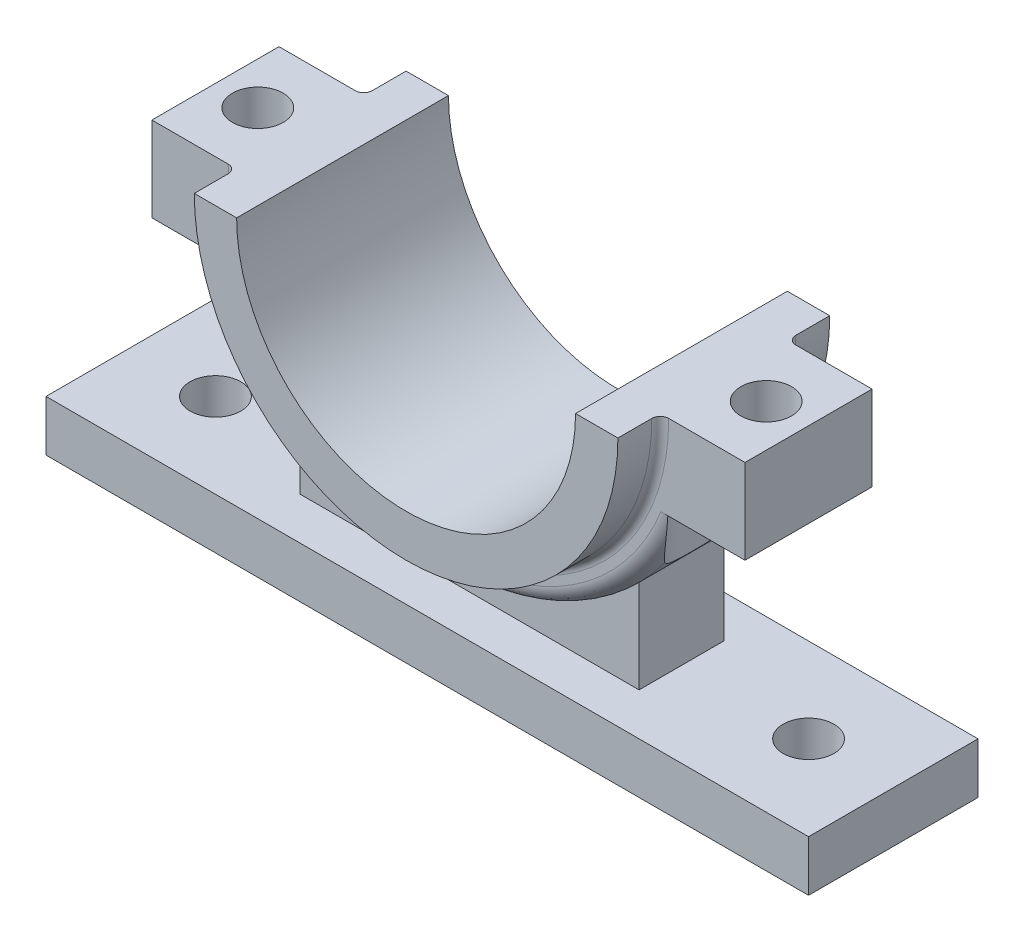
ISO-10303-21;
HEADER;
FILE_DESCRIPTION(('STEP AP214'),'2;1');
FILE_NAME('part.step','',(''),(''),'','','');
FILE_SCHEMA(('AUTOMOTIVE_DESIGN { 1 0 10303 214 1 1 1 1 }'));
ENDSEC;
DATA;
#1=APPLICATION_CONTEXT('core data for automotive mechanical design processes');
#2=APPLICATION_PROTOCOL_DEFINITION('international standard','automotive_design',2000,#1);
#3=PRODUCT_CONTEXT('',#1,'mechanical');
#4=PRODUCT('Part','Part','',(#3));
#5=PRODUCT_RELATED_PRODUCT_CATEGORY('part','',(#4));
#6=PRODUCT_DEFINITION_FORMATION('','',#4);
#7=PRODUCT_DEFINITION_CONTEXT('part definition',#1,'design');
#8=PRODUCT_DEFINITION('design','',#6,#7);
#9=PRODUCT_DEFINITION_SHAPE('','',#8);
#10=(LENGTH_UNIT() NAMED_UNIT(*) SI_UNIT(.MILLI.,.METRE.));
#11=(NAMED_UNIT(*) PLANE_ANGLE_UNIT() SI_UNIT($,.RADIAN.));
#12=(NAMED_UNIT(*) SI_UNIT($,.STERADIAN.) SOLID_ANGLE_UNIT());
#13=UNCERTAINTY_MEASURE_WITH_UNIT(LENGTH_MEASURE(1.E-05),#10,'distance_accuracy_value','');
#14=(GEOMETRIC_REPRESENTATION_CONTEXT(3) GLOBAL_UNCERTAINTY_ASSIGNED_CONTEXT((#13)) GLOBAL_UNIT_ASSIGNED_CONTEXT((#10,
#11,#12)) REPRESENTATION_CONTEXT('',''));
#15=CARTESIAN_POINT('',(0.,0.,0.));
#16=DIRECTION('',(0.,0.,1.));
#17=DIRECTION('',(1.,0.,0.));
#18=AXIS2_PLACEMENT_3D('',#15,#16,#17);
#19=CARTESIAN_POINT('',(0.,0.,15.));
#20=DIRECTION('',(0.,0.,-1.));
#21=DIRECTION('',(-1.,0.,0.));
#22=AXIS2_PLACEMENT_3D('',#19,#20,#21);
#23=CYLINDRICAL_SURFACE('',#22,58.);
#24=DIRECTION('',(0.,0.,-1.));
#25=VECTOR('',#24,1.);
#26=CARTESIAN_POINT('',(-40.,-42.,10.));
#27=LINE('',#26,#25);
#28=CARTESIAN_POINT('',(-40.,-42.,10.));
#29=VERTEX_POINT('',#28);
#30=CARTESIAN_POINT('',(-40.,-42.,-10.));
#31=VERTEX_POINT('',#30);
#32=EDGE_CURVE('E73',#29,#31,#27,.T.);
#33=ORIENTED_EDGE('',*,*,#32,.F.);
#34=CARTESIAN_POINT('',(0.,0.,10.));
#35=DIRECTION('',(0.,0.,1.));
#36=DIRECTION('',(1.,0.,0.));
#37=AXIS2_PLACEMENT_3D('',#34,#35,#36);
#38=CIRCLE('',#37,58.);
#39=CARTESIAN_POINT('',(40.,-42.,10.));
#40=VERTEX_POINT('',#39);
#41=EDGE_CURVE('E78',#29,#40,#38,.T.);
#42=ORIENTED_EDGE('',*,*,#41,.T.);
#43=DIRECTION('',(0.,0.,-1.));
#44=VECTOR('',#43,1.);
#45=CARTESIAN_POINT('',(40.,-42.,10.));
#46=LINE('',#45,#44);
#47=CARTESIAN_POINT('',(40.,-42.,-10.));
#48=VERTEX_POINT('',#47);
#49=EDGE_CURVE('E283',#40,#48,#46,.T.);
#50=ORIENTED_EDGE('',*,*,#49,.T.);
#51=CARTESIAN_POINT('',(0.,0.,-10.));
#52=DIRECTION('',(0.,0.,1.));
#53=DIRECTION('',(1.,0.,0.));
#54=AXIS2_PLACEMENT_3D('',#51,#52,#53);
#55=CIRCLE('',#54,58.);
#56=EDGE_CURVE('E239',#31,#48,#55,.T.);
#57=ORIENTED_EDGE('',*,*,#56,.F.);
#58=EDGE_LOOP('',(#33,#42,#50,#57));
#59=FACE_BOUND('',#58,.T.);
#60=CARTESIAN_POINT('',(52.,-25.6904651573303,15.));
#61=CARTESIAN_POINT('',(51.8464410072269,-26.0012966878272,14.9180901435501));
#62=CARTESIAN_POINT('',(51.6905222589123,-26.3098603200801,14.8319155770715));
#63=CARTESIAN_POINT('',(51.3743247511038,-26.9220597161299,14.6502925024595));
#64=CARTESIAN_POINT('',(51.2140451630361,-27.2256945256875,14.5548422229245));
#65=CARTESIAN_POINT('',(50.8891075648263,-27.8283353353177,14.3536834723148));
#66=CARTESIAN_POINT('',(50.7244389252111,-28.127326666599,14.2479480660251));
#67=CARTESIAN_POINT('',(50.3916528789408,-28.7192737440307,14.025679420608));
#68=CARTESIAN_POINT('',(50.2235356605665,-29.0122298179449,13.9091467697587));
#69=CARTESIAN_POINT('',(49.7104094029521,-29.8887420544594,13.5389800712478));
#70=CARTESIAN_POINT('',(49.360814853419,-30.4621907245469,13.2673101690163));
#71=CARTESIAN_POINT('',(48.6559783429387,-31.5757674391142,12.6698951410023));
#72=CARTESIAN_POINT('',(48.3007436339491,-32.115934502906,12.3442150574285));
#73=CARTESIAN_POINT('',(47.7239295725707,-32.963370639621,11.7642584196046));
#74=CARTESIAN_POINT('',(47.5016328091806,-33.2827295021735,11.5282838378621));
#75=CARTESIAN_POINT('',(47.0604799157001,-33.9036295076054,11.0308360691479));
#76=CARTESIAN_POINT('',(46.8416239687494,-34.2051697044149,10.7693615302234));
#77=CARTESIAN_POINT('',(46.4112812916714,-34.7868273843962,10.2209439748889));
#78=CARTESIAN_POINT('',(46.1997677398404,-35.0670286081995,9.93411119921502));
#79=CARTESIAN_POINT('',(45.7865955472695,-35.6048113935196,9.33337846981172));
#80=CARTESIAN_POINT('',(45.5849352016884,-35.862396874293,9.01948322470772));
#81=CARTESIAN_POINT('',(45.2260091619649,-36.3136017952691,8.41618811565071));
#82=CARTESIAN_POINT('',(45.066755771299,-36.5109043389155,8.13072465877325));
#83=CARTESIAN_POINT('',(44.7604376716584,-36.8857939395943,7.54096141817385));
#84=CARTESIAN_POINT('',(44.6133704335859,-37.0633850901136,7.2366655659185));
#85=CARTESIAN_POINT('',(44.3338642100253,-37.3972719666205,6.6098417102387));
#86=CARTESIAN_POINT('',(44.2014350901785,-37.5535533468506,6.28730162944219));
#87=CARTESIAN_POINT('',(43.9538884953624,-37.8429911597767,5.62557308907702));
#88=CARTESIAN_POINT('',(43.8387711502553,-37.9761474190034,5.28638450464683));
#89=CARTESIAN_POINT('',(43.6275035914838,-38.2186738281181,4.59069644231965));
#90=CARTESIAN_POINT('',(43.531504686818,-38.3278548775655,4.23408469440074));
#91=CARTESIAN_POINT('',(43.3618321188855,-38.5197086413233,3.50857971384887));
#92=CARTESIAN_POINT('',(43.2881589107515,-38.6023808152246,3.13968623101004));
#93=CARTESIAN_POINT('',(43.1650248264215,-38.7400203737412,2.39304534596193));
#94=CARTESIAN_POINT('',(43.1155473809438,-38.7950067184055,2.01530418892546));
#95=CARTESIAN_POINT('',(43.0420315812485,-38.8765555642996,1.25433467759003));
#96=CARTESIAN_POINT('',(43.0179896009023,-38.9031221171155,0.871107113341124));
#97=CARTESIAN_POINT('',(42.9974413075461,-38.9258292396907,0.154406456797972));
#98=CARTESIAN_POINT('',(42.9976832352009,-38.9255628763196,-0.178868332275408));
#99=CARTESIAN_POINT('',(43.0177090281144,-38.9034310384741,-0.844086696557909));
#100=CARTESIAN_POINT('',(43.0374907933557,-38.8815678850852,-1.17603041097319));
#101=CARTESIAN_POINT('',(43.0961909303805,-38.8164943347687,-1.83602642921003));
#102=CARTESIAN_POINT('',(43.1351052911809,-38.773288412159,-2.1640795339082));
#103=CARTESIAN_POINT('',(43.2313017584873,-38.6660022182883,-2.81401500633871));
#104=CARTESIAN_POINT('',(43.2885841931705,-38.6019215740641,-3.13589726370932));
#105=CARTESIAN_POINT('',(43.4186894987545,-38.4555160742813,-3.76297559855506));
#106=CARTESIAN_POINT('',(43.4910639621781,-38.3737154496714,-4.06838787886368));
#107=CARTESIAN_POINT('',(43.6509444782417,-38.19174912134,-4.66959762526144));
#108=CARTESIAN_POINT('',(43.7384500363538,-38.0915840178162,-4.96539540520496));
#109=CARTESIAN_POINT('',(43.9271768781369,-37.8737887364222,-5.54594690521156));
#110=CARTESIAN_POINT('',(44.0283978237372,-37.7561589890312,-5.83070089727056));
#111=CARTESIAN_POINT('',(44.2430666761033,-37.5043788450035,-6.38813845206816));
#112=CARTESIAN_POINT('',(44.356519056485,-37.3702224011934,-6.66081754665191));
#113=CARTESIAN_POINT('',(44.6058099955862,-37.0724020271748,-7.21952137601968));
#114=CARTESIAN_POINT('',(44.7427528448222,-36.9071319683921,-7.50419817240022));
#115=CARTESIAN_POINT('',(45.0274090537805,-36.559309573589,-8.05719278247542));
#116=CARTESIAN_POINT('',(45.1751266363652,-36.3767504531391,-8.32550410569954));
#117=CARTESIAN_POINT('',(45.6313417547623,-35.8052657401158,-9.10515657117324));
#118=CARTESIAN_POINT('',(45.9530506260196,-35.392357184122,-9.59154106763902));
#119=CARTESIAN_POINT('',(46.5506820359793,-34.6010061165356,-10.4076433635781));
#120=CARTESIAN_POINT('',(46.8230636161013,-34.2319181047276,-10.7493154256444));
#121=CARTESIAN_POINT('',(47.3746924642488,-33.4643354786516,-11.3921436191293));
#122=CARTESIAN_POINT('',(47.6539433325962,-33.0658252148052,-11.6932779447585));
#123=CARTESIAN_POINT('',(48.2149582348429,-32.2423191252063,-12.2585506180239));
#124=CARTESIAN_POINT('',(48.4967277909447,-31.8172281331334,-12.5225435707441));
#125=CARTESIAN_POINT('',(49.0574716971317,-30.9456443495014,-13.0153897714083));
#126=CARTESIAN_POINT('',(49.3364466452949,-30.4991562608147,-13.2442506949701));
#127=CARTESIAN_POINT('',(49.8220028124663,-29.6973399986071,-13.619047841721));
#128=CARTESIAN_POINT('',(50.0298714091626,-29.3458875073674,-13.7716956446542));
#129=CARTESIAN_POINT('',(50.4409685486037,-28.6335081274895,-14.0601549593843));
#130=CARTESIAN_POINT('',(50.6441972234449,-28.2725815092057,-14.1959669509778));
#131=CARTESIAN_POINT('',(51.0432010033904,-27.5456328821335,-14.4509983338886));
#132=CARTESIAN_POINT('',(51.2390274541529,-27.1796882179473,-14.5703587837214));
#133=CARTESIAN_POINT('',(51.624395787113,-26.4404214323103,-14.7952288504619));
#134=CARTESIAN_POINT('',(51.8139391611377,-26.0671010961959,-14.9007417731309));
#135=CARTESIAN_POINT('',(52.,-25.6904651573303,-15.));
#136=B_SPLINE_CURVE_WITH_KNOTS('',3,(#60,#61,#62,#63,#64,#65,#66,#67,#68,#69,#70,#71,#72,#73,
#74,#75,#76,#77,#78,#79,#80,#81,#82,#83,#84,#85,#86,#87,#88,#89,#90,#91,#92,#93,#94,#95,#96,#97,
#98,#99,#100,#101,#102,#103,#104,#105,#106,#107,#108,#109,#110,#111,#112,#113,#114,#115,#116,
#117,#118,#119,#120,#121,#122,#123,#124,#125,#126,#127,#128,#129,#130,#131,#132,#133,#134,#135),
.UNSPECIFIED.,.F.,.F.,(4,2,2,2,2,2,2,2,2,2,2,2,2,2,2,2,2,2,2,2,2,2,2,2,2,2,2,2,2,2,2,2,2,2,2,2,
2,4),(0.,1.06870145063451,2.13760739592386,3.20939213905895,4.28111852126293,6.45200584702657,
8.62029759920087,9.98458948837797,11.3489537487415,12.7076537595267,14.0661178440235,
15.2104802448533,16.354604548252,17.4994953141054,18.6443946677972,19.7980234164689,
20.9516756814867,22.1045368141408,23.2572335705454,24.2558143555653,25.2542878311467,
26.2525520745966,27.2508341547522,28.2228575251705,29.1948491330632,30.1668167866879,
31.139141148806,32.207644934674,33.2765697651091,35.4132354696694,37.1269886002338,
38.8416599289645,40.5628671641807,42.2836978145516,43.5910217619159,44.89830844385,
46.1935772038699,47.4885361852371),.UNSPECIFIED.);
#137=CARTESIAN_POINT('',(47.0385186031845,-33.9319579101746,11.0000000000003));
#138=VERTEX_POINT('',#137);
#139=CARTESIAN_POINT('',(47.0385186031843,-33.931957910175,-11.));
#140=VERTEX_POINT('',#139);
#141=EDGE_CURVE('E304',#138,#140,#136,.T.);
#142=ORIENTED_EDGE('',*,*,#141,.F.);
#143=CARTESIAN_POINT('',(0.,0.,11.));
#144=DIRECTION('',(0.,0.,1.));
#145=DIRECTION('',(1.,0.,0.));
#146=AXIS2_PLACEMENT_3D('',#143,#144,#145);
#147=CIRCLE('',#146,58.);
#148=CARTESIAN_POINT('',(-47.0385186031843,-33.931957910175,11.));
#149=VERTEX_POINT('',#148);
#150=EDGE_CURVE('E463',#138,#149,#147,.F.);
#151=ORIENTED_EDGE('',*,*,#150,.T.);
#152=CARTESIAN_POINT('',(-52.,-25.6904651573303,-15.));
#153=CARTESIAN_POINT('',(-51.8464410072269,-26.0012966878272,-14.9180901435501));
#154=CARTESIAN_POINT('',(-51.6905222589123,-26.3098603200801,-14.8319155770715));
#155=CARTESIAN_POINT('',(-51.3743247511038,-26.9220597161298,-14.6502925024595));
#156=CARTESIAN_POINT('',(-51.2140451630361,-27.2256945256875,-14.5548422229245));
#157=CARTESIAN_POINT('',(-50.8891075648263,-27.8283353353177,-14.3536834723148));
#158=CARTESIAN_POINT('',(-50.7244389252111,-28.127326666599,-14.2479480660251));
#159=CARTESIAN_POINT('',(-50.3916528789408,-28.7192737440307,-14.025679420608));
#160=CARTESIAN_POINT('',(-50.2235356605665,-29.0122298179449,-13.9091467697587));
#161=CARTESIAN_POINT('',(-49.7104094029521,-29.8887420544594,-13.5389800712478));
#162=CARTESIAN_POINT('',(-49.360814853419,-30.4621907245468,-13.2673101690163));
#163=CARTESIAN_POINT('',(-48.6559783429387,-31.5757674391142,-12.6698951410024));
#164=CARTESIAN_POINT('',(-48.3007436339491,-32.115934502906,-12.3442150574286));
#165=CARTESIAN_POINT('',(-47.7239295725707,-32.963370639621,-11.7642584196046));
#166=CARTESIAN_POINT('',(-47.5016328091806,-33.2827295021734,-11.5282838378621));
#167=CARTESIAN_POINT('',(-47.0604799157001,-33.9036295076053,-11.0308360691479));
#168=CARTESIAN_POINT('',(-46.8416239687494,-34.2051697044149,-10.7693615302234));
#169=CARTESIAN_POINT('',(-46.4112812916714,-34.7868273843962,-10.2209439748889));
#170=CARTESIAN_POINT('',(-46.1997677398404,-35.0670286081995,-9.93411119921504));
#171=CARTESIAN_POINT('',(-45.7865955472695,-35.6048113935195,-9.33337846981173));
#172=CARTESIAN_POINT('',(-45.5849352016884,-35.862396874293,-9.01948322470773));
#173=CARTESIAN_POINT('',(-45.226009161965,-36.3136017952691,-8.41618811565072));
#174=CARTESIAN_POINT('',(-45.066755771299,-36.5109043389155,-8.13072465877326));
#175=CARTESIAN_POINT('',(-44.7604376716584,-36.8857939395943,-7.54096141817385));
#176=CARTESIAN_POINT('',(-44.6133704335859,-37.0633850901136,-7.23666556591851));
#177=CARTESIAN_POINT('',(-44.3338642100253,-37.3972719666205,-6.60984171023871));
#178=CARTESIAN_POINT('',(-44.2014350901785,-37.5535533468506,-6.2873016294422));
#179=CARTESIAN_POINT('',(-43.9538884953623,-37.8429911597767,-5.62557308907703));
#180=CARTESIAN_POINT('',(-43.8387711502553,-37.9761474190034,-5.28638450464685));
#181=CARTESIAN_POINT('',(-43.6275035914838,-38.2186738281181,-4.59069644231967));
#182=CARTESIAN_POINT('',(-43.531504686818,-38.3278548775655,-4.23408469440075));
#183=CARTESIAN_POINT('',(-43.3618321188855,-38.5197086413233,-3.50857971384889));
#184=CARTESIAN_POINT('',(-43.2881589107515,-38.6023808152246,-3.13968623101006));
#185=CARTESIAN_POINT('',(-43.1650248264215,-38.7400203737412,-2.39304534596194));
#186=CARTESIAN_POINT('',(-43.1155473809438,-38.7950067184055,-2.01530418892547));
#187=CARTESIAN_POINT('',(-43.0420315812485,-38.8765555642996,-1.25433467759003));
#188=CARTESIAN_POINT('',(-43.0179896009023,-38.9031221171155,-0.871107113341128));
#189=CARTESIAN_POINT('',(-42.9974413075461,-38.9258292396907,-0.154406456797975));
#190=CARTESIAN_POINT('',(-42.9976832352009,-38.9255628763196,0.178868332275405));
#191=CARTESIAN_POINT('',(-43.0177090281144,-38.9034310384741,0.844086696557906));
#192=CARTESIAN_POINT('',(-43.0374907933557,-38.8815678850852,1.17603041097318));
#193=CARTESIAN_POINT('',(-43.0961909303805,-38.8164943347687,1.83602642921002));
#194=CARTESIAN_POINT('',(-43.1351052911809,-38.773288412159,2.1640795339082));
#195=CARTESIAN_POINT('',(-43.2313017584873,-38.6660022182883,2.81401500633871));
#196=CARTESIAN_POINT('',(-43.2885841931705,-38.6019215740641,3.13589726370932));
#197=CARTESIAN_POINT('',(-43.4186894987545,-38.4555160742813,3.76297559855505));
#198=CARTESIAN_POINT('',(-43.4910639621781,-38.3737154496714,4.06838787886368));
#199=CARTESIAN_POINT('',(-43.6509444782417,-38.19174912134,4.66959762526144));
#200=CARTESIAN_POINT('',(-43.7384500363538,-38.0915840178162,4.96539540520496));
#201=CARTESIAN_POINT('',(-43.9271768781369,-37.8737887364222,5.54594690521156));
#202=CARTESIAN_POINT('',(-44.0283978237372,-37.7561589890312,5.83070089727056));
#203=CARTESIAN_POINT('',(-44.2430666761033,-37.5043788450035,6.38813845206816));
#204=CARTESIAN_POINT('',(-44.356519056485,-37.3702224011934,6.6608175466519));
#205=CARTESIAN_POINT('',(-44.6058099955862,-37.0724020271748,7.21952137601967));
#206=CARTESIAN_POINT('',(-44.7427528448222,-36.9071319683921,7.50419817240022));
#207=CARTESIAN_POINT('',(-45.0274090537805,-36.559309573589,8.05719278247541));
#208=CARTESIAN_POINT('',(-45.1751266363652,-36.3767504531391,8.32550410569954));
#209=CARTESIAN_POINT('',(-45.6313417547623,-35.8052657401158,9.10515657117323));
#210=CARTESIAN_POINT('',(-45.9530506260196,-35.392357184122,9.59154106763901));
#211=CARTESIAN_POINT('',(-46.5506820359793,-34.6010061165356,10.4076433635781));
#212=CARTESIAN_POINT('',(-46.8230636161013,-34.2319181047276,10.7493154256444));
#213=CARTESIAN_POINT('',(-47.3746924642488,-33.4643354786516,11.3921436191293));
#214=CARTESIAN_POINT('',(-47.6539433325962,-33.0658252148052,11.6932779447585));
#215=CARTESIAN_POINT('',(-48.2149582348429,-32.2423191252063,12.2585506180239));
#216=CARTESIAN_POINT('',(-48.4967277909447,-31.8172281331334,12.5225435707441));
#217=CARTESIAN_POINT('',(-49.0574716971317,-30.9456443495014,13.0153897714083));
#218=CARTESIAN_POINT('',(-49.3364466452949,-30.4991562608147,13.2442506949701));
#219=CARTESIAN_POINT('',(-49.8220028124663,-29.6973399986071,13.619047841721));
#220=CARTESIAN_POINT('',(-50.0298714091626,-29.3458875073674,13.7716956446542));
#221=CARTESIAN_POINT('',(-50.4409685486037,-28.6335081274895,14.0601549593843));
#222=CARTESIAN_POINT('',(-50.6441972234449,-28.2725815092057,14.1959669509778));
#223=CARTESIAN_POINT('',(-51.0432010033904,-27.5456328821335,14.4509983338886));
#224=CARTESIAN_POINT('',(-51.2390274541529,-27.1796882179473,14.5703587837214));
#225=CARTESIAN_POINT('',(-51.624395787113,-26.4404214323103,14.7952288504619));
#226=CARTESIAN_POINT('',(-51.8139391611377,-26.0671010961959,14.9007417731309));
#227=CARTESIAN_POINT('',(-52.,-25.6904651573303,15.));
#228=B_SPLINE_CURVE_WITH_KNOTS('',3,(#152,#153,#154,#155,#156,#157,#158,#159,#160,#161,#162,
#163,#164,#165,#166,#167,#168,#169,#170,#171,#172,#173,#174,#175,#176,#177,#178,#179,#180,#181,
#182,#183,#184,#185,#186,#187,#188,#189,#190,#191,#192,#193,#194,#195,#196,#197,#198,#199,#200,
#201,#202,#203,#204,#205,#206,#207,#208,#209,#210,#211,#212,#213,#214,#215,#216,#217,#218,#219,
#220,#221,#222,#223,#224,#225,#226,#227),.UNSPECIFIED.,.F.,.F.,(4,2,2,2,2,2,2,2,2,2,2,2,2,2,2,2,
2,2,2,2,2,2,2,2,2,2,2,2,2,2,2,2,2,2,2,2,2,4),(0.,1.06870145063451,2.13760739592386,
3.20939213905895,4.28111852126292,6.45200584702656,8.62029759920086,9.98458948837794,
11.3489537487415,12.7076537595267,14.0661178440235,15.2104802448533,16.354604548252,
17.4994953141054,18.6443946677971,19.7980234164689,20.9516756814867,22.1045368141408,
23.2572335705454,24.2558143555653,25.2542878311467,26.2525520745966,27.2508341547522,
28.2228575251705,29.1948491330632,30.1668167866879,31.139141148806,32.207644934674,
33.2765697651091,35.4132354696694,37.1269886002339,38.8416599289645,40.5628671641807,
42.2836978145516,43.5910217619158,44.89830844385,46.1935772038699,47.4885361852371),.UNSPECIFIED.);
#229=CARTESIAN_POINT('',(-47.0385186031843,-33.931957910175,-11.));
#230=VERTEX_POINT('',#229);
#231=EDGE_CURVE('E414',#230,#149,#228,.T.);
#232=ORIENTED_EDGE('',*,*,#231,.F.);
#233=CARTESIAN_POINT('',(0.,0.,-11.));
#234=DIRECTION('',(0.,0.,1.));
#235=DIRECTION('',(1.,0.,0.));
#236=AXIS2_PLACEMENT_3D('',#233,#234,#235);
#237=CIRCLE('',#236,58.);
#238=EDGE_CURVE('E459',#230,#140,#237,.T.);
#239=ORIENTED_EDGE('',*,*,#238,.T.);
#240=EDGE_LOOP('',(#142,#151,#232,#239));
#241=FACE_BOUND('',#240,.T.);
#242=ADVANCED_FACE('F58',(#59,#241),#23,.T.);
#243=CARTESIAN_POINT('',(0.,0.,15.));
#244=DIRECTION('',(0.,0.,1.));
#245=DIRECTION('',(1.,0.,0.));
#246=AXIS2_PLACEMENT_3D('',#243,#244,#245);
#247=PLANE('',#246);
#248=DIRECTION('',(1.,0.,0.));
#249=VECTOR('',#248,1.);
#250=CARTESIAN_POINT('',(0.,0.,15.));
#251=LINE('',#250,#249);
#252=CARTESIAN_POINT('',(52.,0.,15.));
#253=VERTEX_POINT('',#252);
#254=CARTESIAN_POINT('',(70.,0.,15.));
#255=VERTEX_POINT('',#254);
#256=EDGE_CURVE('E488',#253,#255,#251,.T.);
#257=ORIENTED_EDGE('',*,*,#256,.F.);
#258=CARTESIAN_POINT('',(0.,0.,15.));
#259=DIRECTION('',(0.,0.,1.));
#260=DIRECTION('',(1.,0.,0.));
#261=AXIS2_PLACEMENT_3D('',#258,#259,#260);
#262=CIRCLE('',#261,52.);
#263=CARTESIAN_POINT('',(-52.,0.,15.));
#264=VERTEX_POINT('',#263);
#265=EDGE_CURVE('E478',#253,#264,#262,.F.);
#266=ORIENTED_EDGE('',*,*,#265,.T.);
#267=DIRECTION('',(1.,0.,0.));
#268=VECTOR('',#267,1.);
#269=CARTESIAN_POINT('',(0.,0.,15.));
#270=LINE('',#269,#268);
#271=CARTESIAN_POINT('',(-70.,0.,15.));
#272=VERTEX_POINT('',#271);
#273=EDGE_CURVE('E509',#272,#264,#270,.T.);
#274=ORIENTED_EDGE('',*,*,#273,.F.);
#275=DIRECTION('',(0.,-1.,0.));
#276=VECTOR('',#275,1.);
#277=CARTESIAN_POINT('',(-70.,0.,15.));
#278=LINE('',#277,#276);
#279=CARTESIAN_POINT('',(-70.,-20.,15.));
#280=VERTEX_POINT('',#279);
#281=EDGE_CURVE('E539',#272,#280,#278,.T.);
#282=ORIENTED_EDGE('',*,*,#281,.T.);
#283=DIRECTION('',(1.,0.,0.));
#284=VECTOR('',#283,1.);
#285=CARTESIAN_POINT('',(0.,-20.,15.));
#286=LINE('',#285,#284);
#287=CARTESIAN_POINT('',(-50.1597448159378,-20.,15.));
#288=VERTEX_POINT('',#287);
#289=EDGE_CURVE('E443',#280,#288,#286,.T.);
#290=ORIENTED_EDGE('',*,*,#289,.T.);
#291=CARTESIAN_POINT('',(0.,0.,15.));
#292=DIRECTION('',(0.,0.,1.));
#293=DIRECTION('',(1.,0.,0.));
#294=AXIS2_PLACEMENT_3D('',#291,#292,#293);
#295=CIRCLE('',#294,54.);
#296=CARTESIAN_POINT('',(50.1597448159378,-20.,15.));
#297=VERTEX_POINT('',#296);
#298=EDGE_CURVE('E339',#288,#297,#295,.T.);
#299=ORIENTED_EDGE('',*,*,#298,.T.);
#300=DIRECTION('',(-1.,0.,0.));
#301=VECTOR('',#300,1.);
#302=CARTESIAN_POINT('',(0.,-20.,15.));
#303=LINE('',#302,#301);
#304=CARTESIAN_POINT('',(70.,-20.,15.));
#305=VERTEX_POINT('',#304);
#306=EDGE_CURVE('E439',#305,#297,#303,.T.);
#307=ORIENTED_EDGE('',*,*,#306,.F.);
#308=DIRECTION('',(0.,-1.,0.));
#309=VECTOR('',#308,1.);
#310=CARTESIAN_POINT('',(70.,0.,15.));
#311=LINE('',#310,#309);
#312=EDGE_CURVE('E498',#255,#305,#311,.T.);
#313=ORIENTED_EDGE('',*,*,#312,.F.);
#314=EDGE_LOOP('',(#257,#266,#274,#282,#290,#299,#307,#313));
#315=FACE_BOUND('',#314,.T.);
#316=ADVANCED_FACE('F437',(#315),#247,.T.);
#317=CARTESIAN_POINT('',(0.,0.,-15.));
#318=DIRECTION('',(0.,0.,1.));
#319=DIRECTION('',(1.,0.,0.));
#320=AXIS2_PLACEMENT_3D('',#317,#318,#319);
#321=PLANE('',#320);
#322=DIRECTION('',(1.,0.,0.));
#323=VECTOR('',#322,1.);
#324=CARTESIAN_POINT('',(0.,0.,-15.));
#325=LINE('',#324,#323);
#326=CARTESIAN_POINT('',(-70.,0.,-15.));
#327=VERTEX_POINT('',#326);
#328=CARTESIAN_POINT('',(-52.,0.,-15.));
#329=VERTEX_POINT('',#328);
#330=EDGE_CURVE('E541',#327,#329,#325,.T.);
#331=ORIENTED_EDGE('',*,*,#330,.T.);
#332=CARTESIAN_POINT('',(0.,0.,-15.));
#333=DIRECTION('',(0.,0.,1.));
#334=DIRECTION('',(1.,0.,0.));
#335=AXIS2_PLACEMENT_3D('',#332,#333,#334);
#336=CIRCLE('',#335,52.);
#337=CARTESIAN_POINT('',(52.,0.,-15.));
#338=VERTEX_POINT('',#337);
#339=EDGE_CURVE('E466',#329,#338,#336,.T.);
#340=ORIENTED_EDGE('',*,*,#339,.T.);
#341=DIRECTION('',(1.,0.,0.));
#342=VECTOR('',#341,1.);
#343=CARTESIAN_POINT('',(0.,0.,-15.));
#344=LINE('',#343,#342);
#345=CARTESIAN_POINT('',(70.,0.,-15.));
#346=VERTEX_POINT('',#345);
#347=EDGE_CURVE('E532',#338,#346,#344,.T.);
#348=ORIENTED_EDGE('',*,*,#347,.T.);
#349=DIRECTION('',(0.,-1.,0.));
#350=VECTOR('',#349,1.);
#351=CARTESIAN_POINT('',(70.,0.,-15.));
#352=LINE('',#351,#350);
#353=CARTESIAN_POINT('',(70.,-20.,-15.));
#354=VERTEX_POINT('',#353);
#355=EDGE_CURVE('E528',#346,#354,#352,.T.);
#356=ORIENTED_EDGE('',*,*,#355,.T.);
#357=DIRECTION('',(-1.,0.,0.));
#358=VECTOR('',#357,1.);
#359=CARTESIAN_POINT('',(0.,-20.,-15.));
#360=LINE('',#359,#358);
#361=CARTESIAN_POINT('',(50.1597448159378,-20.,-15.));
#362=VERTEX_POINT('',#361);
#363=EDGE_CURVE('E522',#354,#362,#360,.T.);
#364=ORIENTED_EDGE('',*,*,#363,.T.);
#365=CARTESIAN_POINT('',(0.,0.,-15.));
#366=DIRECTION('',(0.,0.,1.));
#367=DIRECTION('',(1.,0.,0.));
#368=AXIS2_PLACEMENT_3D('',#365,#366,#367);
#369=CIRCLE('',#368,54.);
#370=CARTESIAN_POINT('',(-50.1597448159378,-20.,-15.));
#371=VERTEX_POINT('',#370);
#372=EDGE_CURVE('E398',#362,#371,#369,.F.);
#373=ORIENTED_EDGE('',*,*,#372,.T.);
#374=DIRECTION('',(1.,0.,0.));
#375=VECTOR('',#374,1.);
#376=CARTESIAN_POINT('',(0.,-20.,-15.));
#377=LINE('',#376,#375);
#378=CARTESIAN_POINT('',(-70.,-20.,-15.));
#379=VERTEX_POINT('',#378);
#380=EDGE_CURVE('E536',#379,#371,#377,.T.);
#381=ORIENTED_EDGE('',*,*,#380,.F.);
#382=DIRECTION('',(0.,-1.,0.));
#383=VECTOR('',#382,1.);
#384=CARTESIAN_POINT('',(-70.,0.,-15.));
#385=LINE('',#384,#383);
#386=EDGE_CURVE('E564',#327,#379,#385,.T.);
#387=ORIENTED_EDGE('',*,*,#386,.F.);
#388=EDGE_LOOP('',(#331,#340,#348,#356,#364,#373,#381,#387));
#389=FACE_BOUND('',#388,.T.);
#390=ADVANCED_FACE('F571',(#389),#321,.F.);
#391=CARTESIAN_POINT('',(0.,-20.,15.));
#392=DIRECTION('',(0.,1.,0.));
#393=DIRECTION('',(-1.,0.,0.));
#394=AXIS2_PLACEMENT_3D('',#391,#392,#393);
#395=PLANE('',#394);
#396=ORIENTED_EDGE('',*,*,#380,.T.);
#397=CARTESIAN_POINT('',(-50.1597448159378,-20.,-15.));
#398=CARTESIAN_POINT('',(-50.281125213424,-20.,-15.0000055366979));
#399=CARTESIAN_POINT('',(-50.402508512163,-20.,-14.9952328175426));
#400=CARTESIAN_POINT('',(-50.6437660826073,-20.,-14.9762031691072));
#401=CARTESIAN_POINT('',(-50.7636450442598,-20.,-14.9620056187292));
#402=CARTESIAN_POINT('',(-51.0019188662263,-20.,-14.9241970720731));
#403=CARTESIAN_POINT('',(-51.1203136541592,-20.,-14.9005856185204));
#404=CARTESIAN_POINT('',(-51.3555850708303,-20.,-14.843841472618));
#405=CARTESIAN_POINT('',(-51.4724474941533,-20.,-14.8106499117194));
#406=CARTESIAN_POINT('',(-51.5877788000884,-20.,-14.7727632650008));
#407=B_SPLINE_CURVE_WITH_KNOTS('',3,(#397,#398,#399,#400,#401,#402,#403,#404,#405,#406),
.UNSPECIFIED.,.F.,.F.,(4,2,2,2,4),(0.,0.364051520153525,0.725830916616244,1.0876278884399,
1.45169719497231),.UNSPECIFIED.);
#408=CARTESIAN_POINT('',(-51.5877788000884,-20.,-14.7727632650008));
#409=VERTEX_POINT('',#408);
#410=EDGE_CURVE('E370',#371,#409,#407,.T.);
#411=ORIENTED_EDGE('',*,*,#410,.T.);
#412=CARTESIAN_POINT('',(-60.,-20.,0.));
#413=DIRECTION('',(0.,-1.,0.));
#414=DIRECTION('',(1.,0.,0.));
#415=AXIS2_PLACEMENT_3D('',#412,#413,#414);
#416=CIRCLE('',#415,17.);
#417=CARTESIAN_POINT('',(-51.5877788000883,-20.,14.7727632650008));
#418=VERTEX_POINT('',#417);
#419=EDGE_CURVE('E422',#409,#418,#416,.T.);
#420=ORIENTED_EDGE('',*,*,#419,.T.);
#421=CARTESIAN_POINT('',(-51.5877788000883,-20.,14.7727632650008));
#422=CARTESIAN_POINT('',(-51.4724474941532,-20.,14.8106499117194));
#423=CARTESIAN_POINT('',(-51.3555850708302,-20.,14.843841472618));
#424=CARTESIAN_POINT('',(-51.1203136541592,-20.,14.9005856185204));
#425=CARTESIAN_POINT('',(-51.0019188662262,-20.,14.9241970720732));
#426=CARTESIAN_POINT('',(-50.7636450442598,-20.,14.9620056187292));
#427=CARTESIAN_POINT('',(-50.6437660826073,-20.,14.9762031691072));
#428=CARTESIAN_POINT('',(-50.4025085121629,-20.,14.9952328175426));
#429=CARTESIAN_POINT('',(-50.2811252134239,-20.,15.0000055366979));
#430=CARTESIAN_POINT('',(-50.1597448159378,-20.,15.));
#431=B_SPLINE_CURVE_WITH_KNOTS('',3,(#421,#422,#423,#424,#425,#426,#427,#428,#429,#430),
.UNSPECIFIED.,.F.,.F.,(4,2,2,2,4),(0.,0.364069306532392,0.725866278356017,1.08764567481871,
1.4516971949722),.UNSPECIFIED.);
#432=EDGE_CURVE('E371',#418,#288,#431,.T.);
#433=ORIENTED_EDGE('',*,*,#432,.T.);
#434=ORIENTED_EDGE('',*,*,#289,.F.);
#435=DIRECTION('',(0.,0.,-1.));
#436=VECTOR('',#435,1.);
#437=CARTESIAN_POINT('',(-70.,-20.,15.));
#438=LINE('',#437,#436);
#439=EDGE_CURVE('E538',#280,#379,#438,.T.);
#440=ORIENTED_EDGE('',*,*,#439,.T.);
#441=EDGE_LOOP('',(#396,#411,#420,#433,#434,#440));
#442=FACE_BOUND('',#441,.T.);
#443=CARTESIAN_POINT('',(-60.,-20.,0.));
#444=DIRECTION('',(0.,-1.,0.));
#445=DIRECTION('',(1.,0.,0.));
#446=AXIS2_PLACEMENT_3D('',#443,#444,#445);
#447=CIRCLE('',#446,6.);
#448=CARTESIAN_POINT('',(-54.,-20.,0.));
#449=VERTEX_POINT('',#448);
#450=EDGE_CURVE('E427',#449,#449,#447,.T.);
#451=ORIENTED_EDGE('',*,*,#450,.F.);
#452=EDGE_LOOP('',(#451));
#453=FACE_BOUND('',#452,.T.);
#454=ADVANCED_FACE('F388',(#442,#453),#395,.F.);
#455=CARTESIAN_POINT('',(0.,0.,25.));
#456=DIRECTION('',(0.,0.,-1.));
#457=DIRECTION('',(-1.,0.,0.));
#458=AXIS2_PLACEMENT_3D('',#455,#456,#457);
#459=CYLINDRICAL_SURFACE('',#458,50.);
#460=DIRECTION('',(0.,0.,-1.));
#461=VECTOR('',#460,1.);
#462=CARTESIAN_POINT('',(50.,0.,25.));
#463=LINE('',#462,#461);
#464=CARTESIAN_POINT('',(50.,0.,-17.));
#465=VERTEX_POINT('',#464);
#466=CARTESIAN_POINT('',(50.,0.,-25.));
#467=VERTEX_POINT('',#466);
#468=EDGE_CURVE('E559',#465,#467,#463,.T.);
#469=ORIENTED_EDGE('',*,*,#468,.F.);
#470=CARTESIAN_POINT('',(0.,0.,-17.));
#471=DIRECTION('',(0.,0.,1.));
#472=DIRECTION('',(1.,0.,0.));
#473=AXIS2_PLACEMENT_3D('',#470,#471,#472);
#474=CIRCLE('',#473,50.);
#475=CARTESIAN_POINT('',(-50.,0.,-17.));
#476=VERTEX_POINT('',#475);
#477=EDGE_CURVE('E468',#465,#476,#474,.F.);
#478=ORIENTED_EDGE('',*,*,#477,.T.);
#479=DIRECTION('',(0.,0.,-1.));
#480=VECTOR('',#479,1.);
#481=CARTESIAN_POINT('',(-50.,0.,25.));
#482=LINE('',#481,#480);
#483=CARTESIAN_POINT('',(-50.,0.,-25.));
#484=VERTEX_POINT('',#483);
#485=EDGE_CURVE('E516',#476,#484,#482,.T.);
#486=ORIENTED_EDGE('',*,*,#485,.T.);
#487=CARTESIAN_POINT('',(0.,0.,-25.));
#488=DIRECTION('',(0.,0.,1.));
#489=DIRECTION('',(1.,0.,0.));
#490=AXIS2_PLACEMENT_3D('',#487,#488,#489);
#491=CIRCLE('',#490,50.);
#492=EDGE_CURVE('E521',#484,#467,#491,.T.);
#493=ORIENTED_EDGE('',*,*,#492,.T.);
#494=EDGE_LOOP('',(#469,#478,#486,#493));
#495=FACE_BOUND('',#494,.T.);
#496=ADVANCED_FACE('F591',(#495),#459,.T.);
#497=CARTESIAN_POINT('',(0.,0.,25.));
#498=DIRECTION('',(0.,1.,0.));
#499=DIRECTION('',(0.,0.,1.));
#500=AXIS2_PLACEMENT_3D('',#497,#498,#499);
#501=PLANE('',#500);
#502=CARTESIAN_POINT('',(-60.,0.,0.));
#503=DIRECTION('',(0.,1.,0.));
#504=DIRECTION('',(0.,0.,1.));
#505=AXIS2_PLACEMENT_3D('',#502,#503,#504);
#506=CIRCLE('',#505,6.);
#507=CARTESIAN_POINT('',(-60.,0.,6.));
#508=VERTEX_POINT('',#507);
#509=EDGE_CURVE('E423',#508,#508,#506,.T.);
#510=ORIENTED_EDGE('',*,*,#509,.F.);
#511=EDGE_LOOP('',(#510));
#512=FACE_BOUND('',#511,.T.);
#513=DIRECTION('',(1.,0.,0.));
#514=VECTOR('',#513,1.);
#515=CARTESIAN_POINT('',(0.,0.,-25.));
#516=LINE('',#515,#514);
#517=CARTESIAN_POINT('',(-40.,0.,-25.));
#518=VERTEX_POINT('',#517);
#519=EDGE_CURVE('E551',#484,#518,#516,.T.);
#520=ORIENTED_EDGE('',*,*,#519,.F.);
#521=ORIENTED_EDGE('',*,*,#485,.F.);
#522=CARTESIAN_POINT('',(-52.,0.,-17.));
#523=DIRECTION('',(0.,1.,0.));
#524=DIRECTION('',(0.,0.,1.));
#525=AXIS2_PLACEMENT_3D('',#522,#523,#524);
#526=CIRCLE('',#525,2.);
#527=EDGE_CURVE('E482',#476,#329,#526,.F.);
#528=ORIENTED_EDGE('',*,*,#527,.T.);
#529=ORIENTED_EDGE('',*,*,#330,.F.);
#530=DIRECTION('',(0.,0.,-1.));
#531=VECTOR('',#530,1.);
#532=CARTESIAN_POINT('',(-70.,0.,15.));
#533=LINE('',#532,#531);
#534=EDGE_CURVE('E566',#272,#327,#533,.T.);
#535=ORIENTED_EDGE('',*,*,#534,.F.);
#536=ORIENTED_EDGE('',*,*,#273,.T.);
#537=CARTESIAN_POINT('',(-52.,0.,17.));
#538=DIRECTION('',(0.,1.,0.));
#539=DIRECTION('',(0.,0.,1.));
#540=AXIS2_PLACEMENT_3D('',#537,#538,#539);
#541=CIRCLE('',#540,2.);
#542=CARTESIAN_POINT('',(-50.,0.,17.));
#543=VERTEX_POINT('',#542);
#544=EDGE_CURVE('E14',#264,#543,#541,.F.);
#545=ORIENTED_EDGE('',*,*,#544,.T.);
#546=CARTESIAN_POINT('',(-50.,0.,25.));
#547=VERTEX_POINT('',#546);
#548=EDGE_CURVE('E507',#547,#543,#482,.T.);
#549=ORIENTED_EDGE('',*,*,#548,.F.);
#550=DIRECTION('',(1.,0.,0.));
#551=VECTOR('',#550,1.);
#552=CARTESIAN_POINT('',(0.,0.,25.));
#553=LINE('',#552,#551);
#554=CARTESIAN_POINT('',(-40.,0.,25.));
#555=VERTEX_POINT('',#554);
#556=EDGE_CURVE('E518',#547,#555,#553,.T.);
#557=ORIENTED_EDGE('',*,*,#556,.T.);
#558=DIRECTION('',(0.,0.,-1.));
#559=VECTOR('',#558,1.);
#560=CARTESIAN_POINT('',(-40.,0.,25.));
#561=LINE('',#560,#559);
#562=EDGE_CURVE('E515',#555,#518,#561,.T.);
#563=ORIENTED_EDGE('',*,*,#562,.T.);
#564=EDGE_LOOP('',(#520,#521,#528,#529,#535,#536,#545,#549,#557,#563));
#565=FACE_BOUND('',#564,.T.);
#566=ADVANCED_FACE('F505',(#512,#565),#501,.T.);
#567=ORIENTED_EDGE('',*,*,#548,.T.);
#568=CARTESIAN_POINT('',(0.,0.,17.));
#569=DIRECTION('',(0.,0.,1.));
#570=DIRECTION('',(1.,0.,0.));
#571=AXIS2_PLACEMENT_3D('',#568,#569,#570);
#572=CIRCLE('',#571,50.);
#573=CARTESIAN_POINT('',(50.,0.,17.));
#574=VERTEX_POINT('',#573);
#575=EDGE_CURVE('E473',#543,#574,#572,.T.);
#576=ORIENTED_EDGE('',*,*,#575,.T.);
#577=CARTESIAN_POINT('',(50.,0.,25.));
#578=VERTEX_POINT('',#577);
#579=EDGE_CURVE('E492',#578,#574,#463,.T.);
#580=ORIENTED_EDGE('',*,*,#579,.F.);
#581=CARTESIAN_POINT('',(0.,0.,25.));
#582=DIRECTION('',(0.,0.,1.));
#583=DIRECTION('',(1.,0.,0.));
#584=AXIS2_PLACEMENT_3D('',#581,#582,#583);
#585=CIRCLE('',#584,50.);
#586=EDGE_CURVE('E512',#547,#578,#585,.T.);
#587=ORIENTED_EDGE('',*,*,#586,.F.);
#588=EDGE_LOOP('',(#567,#576,#580,#587));
#589=FACE_BOUND('',#588,.T.);
#590=ADVANCED_FACE('F511',(#589),#459,.T.);
#591=CARTESIAN_POINT('',(0.,0.,25.));
#592=DIRECTION('',(0.,1.,0.));
#593=DIRECTION('',(0.,0.,1.));
#594=AXIS2_PLACEMENT_3D('',#591,#592,#593);
#595=PLANE('',#594);
#596=CARTESIAN_POINT('',(60.,0.,0.));
#597=DIRECTION('',(0.,1.,0.));
#598=DIRECTION('',(0.,0.,1.));
#599=AXIS2_PLACEMENT_3D('',#596,#597,#598);
#600=CIRCLE('',#599,6.);
#601=CARTESIAN_POINT('',(60.,0.,6.));
#602=VERTEX_POINT('',#601);
#603=EDGE_CURVE('E312',#602,#602,#600,.T.);
#604=ORIENTED_EDGE('',*,*,#603,.F.);
#605=EDGE_LOOP('',(#604));
#606=FACE_BOUND('',#605,.T.);
#607=DIRECTION('',(1.,0.,0.));
#608=VECTOR('',#607,1.);
#609=CARTESIAN_POINT('',(0.,0.,-25.));
#610=LINE('',#609,#608);
#611=CARTESIAN_POINT('',(40.,0.,-25.));
#612=VERTEX_POINT('',#611);
#613=EDGE_CURVE('E545',#612,#467,#610,.T.);
#614=ORIENTED_EDGE('',*,*,#613,.F.);
#615=DIRECTION('',(0.,0.,-1.));
#616=VECTOR('',#615,1.);
#617=CARTESIAN_POINT('',(40.,0.,25.));
#618=LINE('',#617,#616);
#619=CARTESIAN_POINT('',(40.,0.,25.));
#620=VERTEX_POINT('',#619);
#621=EDGE_CURVE('E558',#620,#612,#618,.T.);
#622=ORIENTED_EDGE('',*,*,#621,.F.);
#623=DIRECTION('',(1.,0.,0.));
#624=VECTOR('',#623,1.);
#625=CARTESIAN_POINT('',(0.,0.,25.));
#626=LINE('',#625,#624);
#627=EDGE_CURVE('E514',#620,#578,#626,.T.);
#628=ORIENTED_EDGE('',*,*,#627,.T.);
#629=ORIENTED_EDGE('',*,*,#579,.T.);
#630=CARTESIAN_POINT('',(52.,0.,17.));
#631=DIRECTION('',(0.,1.,0.));
#632=DIRECTION('',(0.,0.,1.));
#633=AXIS2_PLACEMENT_3D('',#630,#631,#632);
#634=CIRCLE('',#633,2.);
#635=EDGE_CURVE('E66',#574,#253,#634,.F.);
#636=ORIENTED_EDGE('',*,*,#635,.T.);
#637=ORIENTED_EDGE('',*,*,#256,.T.);
#638=DIRECTION('',(0.,0.,-1.));
#639=VECTOR('',#638,1.);
#640=CARTESIAN_POINT('',(70.,0.,15.));
#641=LINE('',#640,#639);
#642=EDGE_CURVE('E499',#255,#346,#641,.T.);
#643=ORIENTED_EDGE('',*,*,#642,.T.);
#644=ORIENTED_EDGE('',*,*,#347,.F.);
#645=CARTESIAN_POINT('',(52.,0.,-17.));
#646=DIRECTION('',(0.,1.,0.));
#647=DIRECTION('',(0.,0.,1.));
#648=AXIS2_PLACEMENT_3D('',#645,#646,#647);
#649=CIRCLE('',#648,2.);
#650=EDGE_CURVE('E480',#338,#465,#649,.F.);
#651=ORIENTED_EDGE('',*,*,#650,.T.);
#652=ORIENTED_EDGE('',*,*,#468,.T.);
#653=EDGE_LOOP('',(#614,#622,#628,#629,#636,#637,#643,#644,#651,#652));
#654=FACE_BOUND('',#653,.T.);
#655=ADVANCED_FACE('F486',(#606,#654),#595,.T.);
#656=CARTESIAN_POINT('',(0.,0.,25.));
#657=DIRECTION('',(0.,0.,-1.));
#658=DIRECTION('',(-1.,0.,0.));
#659=AXIS2_PLACEMENT_3D('',#656,#657,#658);
#660=CYLINDRICAL_SURFACE('',#659,40.);
#661=CARTESIAN_POINT('',(0.,0.,-25.));
#662=DIRECTION('',(0.,0.,1.));
#663=DIRECTION('',(1.,0.,0.));
#664=AXIS2_PLACEMENT_3D('',#661,#662,#663);
#665=CIRCLE('',#664,40.);
#666=EDGE_CURVE('E547',#518,#612,#665,.T.);
#667=ORIENTED_EDGE('',*,*,#666,.F.);
#668=ORIENTED_EDGE('',*,*,#562,.F.);
#669=CARTESIAN_POINT('',(0.,0.,25.));
#670=DIRECTION('',(0.,0.,1.));
#671=DIRECTION('',(1.,0.,0.));
#672=AXIS2_PLACEMENT_3D('',#669,#670,#671);
#673=CIRCLE('',#672,40.);
#674=EDGE_CURVE('E556',#555,#620,#673,.T.);
#675=ORIENTED_EDGE('',*,*,#674,.T.);
#676=ORIENTED_EDGE('',*,*,#621,.T.);
#677=EDGE_LOOP('',(#667,#668,#675,#676));
#678=FACE_BOUND('',#677,.T.);
#679=ADVANCED_FACE('F614',(#678),#660,.F.);
#680=CARTESIAN_POINT('',(0.,0.,25.));
#681=DIRECTION('',(0.,0.,1.));
#682=DIRECTION('',(1.,0.,0.));
#683=AXIS2_PLACEMENT_3D('',#680,#681,#682);
#684=PLANE('',#683);
#685=ORIENTED_EDGE('',*,*,#556,.F.);
#686=ORIENTED_EDGE('',*,*,#586,.T.);
#687=ORIENTED_EDGE('',*,*,#627,.F.);
#688=ORIENTED_EDGE('',*,*,#674,.F.);
#689=EDGE_LOOP('',(#685,#686,#687,#688));
#690=FACE_BOUND('',#689,.T.);
#691=ADVANCED_FACE('F618',(#690),#684,.T.);
#692=CARTESIAN_POINT('',(0.,0.,-25.));
#693=DIRECTION('',(0.,0.,1.));
#694=DIRECTION('',(1.,0.,0.));
#695=AXIS2_PLACEMENT_3D('',#692,#693,#694);
#696=PLANE('',#695);
#697=ORIENTED_EDGE('',*,*,#519,.T.);
#698=ORIENTED_EDGE('',*,*,#666,.T.);
#699=ORIENTED_EDGE('',*,*,#613,.T.);
#700=ORIENTED_EDGE('',*,*,#492,.F.);
#701=EDGE_LOOP('',(#697,#698,#699,#700));
#702=FACE_BOUND('',#701,.T.);
#703=ADVANCED_FACE('F386',(#702),#696,.F.);
#704=CARTESIAN_POINT('',(0.,-20.,15.));
#705=DIRECTION('',(0.,-1.,0.));
#706=DIRECTION('',(1.,0.,0.));
#707=AXIS2_PLACEMENT_3D('',#704,#705,#706);
#708=PLANE('',#707);
#709=ORIENTED_EDGE('',*,*,#306,.T.);
#710=CARTESIAN_POINT('',(50.1597448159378,-20.,15.));
#711=CARTESIAN_POINT('',(50.281125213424,-20.,15.0000055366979));
#712=CARTESIAN_POINT('',(50.402508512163,-20.,14.9952328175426));
#713=CARTESIAN_POINT('',(50.6437660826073,-20.,14.9762031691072));
#714=CARTESIAN_POINT('',(50.7636450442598,-20.,14.9620056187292));
#715=CARTESIAN_POINT('',(51.0019188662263,-20.,14.9241970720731));
#716=CARTESIAN_POINT('',(51.1203136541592,-20.,14.9005856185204));
#717=CARTESIAN_POINT('',(51.3555850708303,-20.,14.843841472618));
#718=CARTESIAN_POINT('',(51.4724474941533,-20.,14.8106499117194));
#719=CARTESIAN_POINT('',(51.5877788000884,-20.,14.7727632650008));
#720=B_SPLINE_CURVE_WITH_KNOTS('',3,(#710,#711,#712,#713,#714,#715,#716,#717,#718,#719),
.UNSPECIFIED.,.F.,.F.,(4,2,2,2,4),(0.,0.364051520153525,0.725830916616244,1.0876278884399,
1.45169719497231),.UNSPECIFIED.);
#721=CARTESIAN_POINT('',(51.5877788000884,-20.,14.7727632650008));
#722=VERTEX_POINT('',#721);
#723=EDGE_CURVE('E393',#297,#722,#720,.T.);
#724=ORIENTED_EDGE('',*,*,#723,.T.);
#725=CARTESIAN_POINT('',(60.,-20.,0.));
#726=DIRECTION('',(0.,-1.,0.));
#727=DIRECTION('',(1.,0.,0.));
#728=AXIS2_PLACEMENT_3D('',#725,#726,#727);
#729=CIRCLE('',#728,17.);
#730=CARTESIAN_POINT('',(51.5877788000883,-20.,-14.7727632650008));
#731=VERTEX_POINT('',#730);
#732=EDGE_CURVE('E301',#722,#731,#729,.T.);
#733=ORIENTED_EDGE('',*,*,#732,.T.);
#734=CARTESIAN_POINT('',(51.5877788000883,-20.,-14.7727632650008));
#735=CARTESIAN_POINT('',(51.4724474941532,-20.,-14.8106499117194));
#736=CARTESIAN_POINT('',(51.3555850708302,-20.,-14.843841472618));
#737=CARTESIAN_POINT('',(51.1203136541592,-20.,-14.9005856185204));
#738=CARTESIAN_POINT('',(51.0019188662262,-20.,-14.9241970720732));
#739=CARTESIAN_POINT('',(50.7636450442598,-20.,-14.9620056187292));
#740=CARTESIAN_POINT('',(50.6437660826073,-20.,-14.9762031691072));
#741=CARTESIAN_POINT('',(50.4025085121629,-20.,-14.9952328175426));
#742=CARTESIAN_POINT('',(50.2811252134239,-20.,-15.0000055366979));
#743=CARTESIAN_POINT('',(50.1597448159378,-20.,-15.));
#744=B_SPLINE_CURVE_WITH_KNOTS('',3,(#734,#735,#736,#737,#738,#739,#740,#741,#742,#743),
.UNSPECIFIED.,.F.,.F.,(4,2,2,2,4),(0.,0.36406930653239,0.725866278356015,1.08764567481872,
1.45169719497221),.UNSPECIFIED.);
#745=EDGE_CURVE('E363',#731,#362,#744,.T.);
#746=ORIENTED_EDGE('',*,*,#745,.T.);
#747=ORIENTED_EDGE('',*,*,#363,.F.);
#748=DIRECTION('',(0.,0.,-1.));
#749=VECTOR('',#748,1.);
#750=CARTESIAN_POINT('',(70.,-20.,15.));
#751=LINE('',#750,#749);
#752=EDGE_CURVE('E544',#305,#354,#751,.T.);
#753=ORIENTED_EDGE('',*,*,#752,.F.);
#754=EDGE_LOOP('',(#709,#724,#733,#746,#747,#753));
#755=FACE_BOUND('',#754,.T.);
#756=CARTESIAN_POINT('',(60.,-20.,0.));
#757=DIRECTION('',(0.,-1.,0.));
#758=DIRECTION('',(1.,0.,0.));
#759=AXIS2_PLACEMENT_3D('',#756,#757,#758);
#760=CIRCLE('',#759,6.);
#761=CARTESIAN_POINT('',(66.,-20.,0.));
#762=VERTEX_POINT('',#761);
#763=EDGE_CURVE('E421',#762,#762,#760,.T.);
#764=ORIENTED_EDGE('',*,*,#763,.F.);
#765=EDGE_LOOP('',(#764));
#766=FACE_BOUND('',#765,.T.);
#767=ADVANCED_FACE('F381',(#755,#766),#708,.T.);
#768=CARTESIAN_POINT('',(70.,0.,15.));
#769=DIRECTION('',(1.,0.,0.));
#770=DIRECTION('',(0.,0.,-1.));
#771=AXIS2_PLACEMENT_3D('',#768,#769,#770);
#772=PLANE('',#771);
#773=ORIENTED_EDGE('',*,*,#355,.F.);
#774=ORIENTED_EDGE('',*,*,#642,.F.);
#775=ORIENTED_EDGE('',*,*,#312,.T.);
#776=ORIENTED_EDGE('',*,*,#752,.T.);
#777=EDGE_LOOP('',(#773,#774,#775,#776));
#778=FACE_BOUND('',#777,.T.);
#779=ADVANCED_FACE('F385',(#778),#772,.T.);
#780=CARTESIAN_POINT('',(-70.,0.,15.));
#781=DIRECTION('',(1.,0.,0.));
#782=DIRECTION('',(0.,0.,-1.));
#783=AXIS2_PLACEMENT_3D('',#780,#781,#782);
#784=PLANE('',#783);
#785=ORIENTED_EDGE('',*,*,#386,.T.);
#786=ORIENTED_EDGE('',*,*,#439,.F.);
#787=ORIENTED_EDGE('',*,*,#281,.F.);
#788=ORIENTED_EDGE('',*,*,#534,.T.);
#789=EDGE_LOOP('',(#785,#786,#787,#788));
#790=FACE_BOUND('',#789,.T.);
#791=ADVANCED_FACE('F575',(#790),#784,.F.);
#792=CARTESIAN_POINT('',(-60.,10.,0.));
#793=DIRECTION('',(0.,-1.,0.));
#794=DIRECTION('',(1.,0.,0.));
#795=AXIS2_PLACEMENT_3D('',#792,#793,#794);
#796=CYLINDRICAL_SURFACE('',#795,6.);
#797=ORIENTED_EDGE('',*,*,#509,.T.);
#798=EDGE_LOOP('',(#797));
#799=FACE_BOUND('',#798,.T.);
#800=ORIENTED_EDGE('',*,*,#450,.T.);
#801=EDGE_LOOP('',(#800));
#802=FACE_BOUND('',#801,.T.);
#803=ADVANCED_FACE('F408',(#799,#802),#796,.F.);
#804=CARTESIAN_POINT('',(-60.,-50.,0.));
#805=DIRECTION('',(0.,1.,0.));
#806=DIRECTION('',(-1.,0.,0.));
#807=AXIS2_PLACEMENT_3D('',#804,#805,#806);
#808=CYLINDRICAL_SURFACE('',#807,17.);
#809=ORIENTED_EDGE('',*,*,#231,.T.);
#810=CARTESIAN_POINT('',(-47.0385186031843,-33.931957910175,11.));
#811=CARTESIAN_POINT('',(-47.1028245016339,-33.8427663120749,11.0757614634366));
#812=CARTESIAN_POINT('',(-47.1661412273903,-33.7508263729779,11.14903305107));
#813=CARTESIAN_POINT('',(-47.2908650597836,-33.5623539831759,11.2910086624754));
#814=CARTESIAN_POINT('',(-47.3522733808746,-33.465824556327,11.3597156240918));
#815=CARTESIAN_POINT('',(-47.4731684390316,-33.2692259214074,11.4928908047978));
#816=CARTESIAN_POINT('',(-47.5326599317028,-33.1691670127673,11.5573700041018));
#817=CARTESIAN_POINT('',(-47.6500015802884,-32.9658305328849,11.6826753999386));
#818=CARTESIAN_POINT('',(-47.7078514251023,-32.8625523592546,11.7435009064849));
#819=CARTESIAN_POINT('',(-47.8780477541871,-32.5505005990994,11.9199361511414));
#820=CARTESIAN_POINT('',(-47.988122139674,-32.3377271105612,12.0306865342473));
#821=CARTESIAN_POINT('',(-48.2027998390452,-31.9039725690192,12.2412685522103));
#822=CARTESIAN_POINT('',(-48.3073979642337,-31.6829840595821,12.3410899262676));
#823=CARTESIAN_POINT('',(-48.526194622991,-31.2023315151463,12.5450101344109));
#824=CARTESIAN_POINT('',(-48.6395999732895,-30.9416887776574,12.6476470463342));
#825=CARTESIAN_POINT('',(-48.8601984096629,-30.4138804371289,12.8423691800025));
#826=CARTESIAN_POINT('',(-48.9673900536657,-30.146713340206,12.934451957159));
#827=CARTESIAN_POINT('',(-49.1759323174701,-29.6070296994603,13.1094656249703));
#828=CARTESIAN_POINT('',(-49.2772804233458,-29.3345109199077,13.1923925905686));
#829=CARTESIAN_POINT('',(-49.4743459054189,-28.785124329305,13.3501509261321));
#830=CARTESIAN_POINT('',(-49.5700629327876,-28.5082562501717,13.4249817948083));
#831=CARTESIAN_POINT('',(-49.7569924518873,-27.9480105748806,13.5681536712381));
#832=CARTESIAN_POINT('',(-49.8481487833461,-27.6645953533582,13.6364203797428));
#833=CARTESIAN_POINT('',(-50.0250202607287,-27.0945670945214,13.766329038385));
#834=CARTESIAN_POINT('',(-50.1107352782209,-26.8079539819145,13.8279708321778));
#835=CARTESIAN_POINT('',(-50.2767645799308,-26.2320822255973,13.945214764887));
#836=CARTESIAN_POINT('',(-50.3570811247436,-25.9428247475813,14.0008194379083));
#837=CARTESIAN_POINT('',(-50.5123904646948,-25.3618828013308,14.106526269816));
#838=CARTESIAN_POINT('',(-50.5873831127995,-25.0701982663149,14.1566282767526));
#839=CARTESIAN_POINT('',(-50.7572598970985,-24.3826393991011,14.2683356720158));
#840=CARTESIAN_POINT('',(-50.8499661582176,-23.9858868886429,14.3278635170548));
#841=CARTESIAN_POINT('',(-51.0256012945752,-23.1890838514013,14.4385221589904));
#842=CARTESIAN_POINT('',(-51.108530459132,-22.7890334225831,14.489653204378));
#843=CARTESIAN_POINT('',(-51.2632485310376,-21.992136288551,14.5834585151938));
#844=CARTESIAN_POINT('',(-51.3351864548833,-21.5953321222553,14.6262485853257));
#845=CARTESIAN_POINT('',(-51.469063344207,-20.7993525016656,14.7047277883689));
#846=CARTESIAN_POINT('',(-51.5310025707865,-20.4001771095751,14.7404171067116));
#847=CARTESIAN_POINT('',(-51.5877788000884,-20.,14.7727632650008));
#848=B_SPLINE_CURVE_WITH_KNOTS('',3,(#810,#811,#812,#813,#814,#815,#816,#817,#818,#819,#820,
#821,#822,#823,#824,#825,#826,#827,#828,#829,#830,#831,#832,#833,#834,#835,#836,#837,#838,#839,
#840,#841,#842,#843,#844,#845,#846,#847),.UNSPECIFIED.,.F.,.F.,(4,2,2,2,2,2,2,2,2,2,2,2,2,2,2,2,
2,2,4),(0.,0.400456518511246,0.800652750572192,1.19976467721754,1.59895173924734,
2.39015268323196,3.18209019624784,4.08832463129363,4.99476854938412,5.90159955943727,
6.80848668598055,7.72465993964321,8.6408548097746,9.55666360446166,10.4724976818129,
11.707557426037,12.9425806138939,14.1589967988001,15.3753812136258),.UNSPECIFIED.);
#849=EDGE_CURVE('E400',#149,#418,#848,.T.);
#850=ORIENTED_EDGE('',*,*,#849,.T.);
#851=ORIENTED_EDGE('',*,*,#419,.F.);
#852=CARTESIAN_POINT('',(-51.5877788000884,-20.,-14.7727632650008));
#853=CARTESIAN_POINT('',(-51.5414830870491,-20.3263696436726,-14.7463939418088));
#854=CARTESIAN_POINT('',(-51.4917434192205,-20.652069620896,-14.7177883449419));
#855=CARTESIAN_POINT('',(-51.3855697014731,-21.3019384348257,-14.6559004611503));
#856=CARTESIAN_POINT('',(-51.3291354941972,-21.6261072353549,-14.6226180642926));
#857=CARTESIAN_POINT('',(-51.2097006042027,-22.273073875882,-14.5511330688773));
#858=CARTESIAN_POINT('',(-51.1466925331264,-22.5958697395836,-14.5129249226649));
#859=CARTESIAN_POINT('',(-51.0142908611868,-23.2394901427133,-14.4313229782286));
#860=CARTESIAN_POINT('',(-50.9448972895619,-23.5603146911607,-14.3879292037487));
#861=CARTESIAN_POINT('',(-50.7976514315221,-24.2092487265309,-14.2942164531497));
#862=CARTESIAN_POINT('',(-50.719608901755,-24.5372909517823,-14.2437298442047));
#863=CARTESIAN_POINT('',(-50.5568874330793,-25.1906734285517,-14.1363760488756));
#864=CARTESIAN_POINT('',(-50.4722085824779,-25.5160137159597,-14.0795089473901));
#865=CARTESIAN_POINT('',(-50.296245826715,-26.1634422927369,-13.9588157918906));
#866=CARTESIAN_POINT('',(-50.2049650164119,-26.4855320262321,-13.894992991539));
#867=CARTESIAN_POINT('',(-50.0157041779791,-27.1260842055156,-13.7596281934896));
#868=CARTESIAN_POINT('',(-49.9177245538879,-27.4445468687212,-13.6880866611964));
#869=CARTESIAN_POINT('',(-49.6862952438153,-28.166567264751,-13.5149516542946));
#870=CARTESIAN_POINT('',(-49.5506421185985,-28.5687611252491,-13.4105766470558));
#871=CARTESIAN_POINT('',(-49.2675736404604,-29.3644666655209,-13.1851376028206));
#872=CARTESIAN_POINT('',(-49.120155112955,-29.7579759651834,-13.0640690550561));
#873=CARTESIAN_POINT('',(-48.8904815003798,-30.3373236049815,-12.8681202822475));
#874=CARTESIAN_POINT('',(-48.8129437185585,-30.5276143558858,-12.8008172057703));
#875=CARTESIAN_POINT('',(-48.6546664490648,-30.9048161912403,-12.660750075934));
#876=CARTESIAN_POINT('',(-48.5739272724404,-31.0917276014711,-12.5879865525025));
#877=CARTESIAN_POINT('',(-48.4091119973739,-31.4614650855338,-12.4363919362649));
#878=CARTESIAN_POINT('',(-48.3250375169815,-31.64429307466,-12.3575637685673));
#879=CARTESIAN_POINT('',(-48.1533132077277,-32.0050910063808,-12.1930373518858));
#880=CARTESIAN_POINT('',(-48.0656640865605,-32.1830618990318,-12.1073404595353));
#881=CARTESIAN_POINT('',(-47.9037790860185,-32.4992866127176,-11.9453712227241));
#882=CARTESIAN_POINT('',(-47.8302148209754,-32.6385829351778,-11.8704668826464));
#883=CARTESIAN_POINT('',(-47.6804311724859,-32.9123937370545,-11.7149425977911));
#884=CARTESIAN_POINT('',(-47.6042130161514,-33.0469103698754,-11.6343252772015));
#885=CARTESIAN_POINT('',(-47.4483541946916,-33.3110255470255,-11.4660123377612));
#886=CARTESIAN_POINT('',(-47.368693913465,-33.4405848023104,-11.3782726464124));
#887=CARTESIAN_POINT('',(-47.2467880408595,-33.6293703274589,-11.2409666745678));
#888=CARTESIAN_POINT('',(-47.20572163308,-33.6914132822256,-11.1942151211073));
#889=CARTESIAN_POINT('',(-47.1227534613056,-33.8133609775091,-11.0986718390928));
#890=CARTESIAN_POINT('',(-47.08085149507,-33.8732651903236,-11.0498796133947));
#891=CARTESIAN_POINT('',(-47.0385186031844,-33.9319579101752,-11.0000000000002));
#892=B_SPLINE_CURVE_WITH_KNOTS('',3,(#852,#853,#854,#855,#856,#857,#858,#859,#860,#861,#862,
#863,#864,#865,#866,#867,#868,#869,#870,#871,#872,#873,#874,#875,#876,#877,#878,#879,#880,#881,
#882,#883,#884,#885,#886,#887,#888,#889,#890,#891),.UNSPECIFIED.,.F.,.F.,(4,2,2,2,2,2,2,2,2,2,2,
2,2,2,2,2,2,2,2,4),(0.,0.99204266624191,1.98410865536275,2.97730188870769,3.97049057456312,
4.99322988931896,6.01595559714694,7.03820494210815,8.0603926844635,9.37121818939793,
10.6823985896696,11.3309722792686,11.9794831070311,12.6276830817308,13.2757553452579,
13.7988917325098,14.3217893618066,14.8482136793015,15.1117819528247,15.3754148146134),.UNSPECIFIED.);
#893=EDGE_CURVE('E356',#409,#230,#892,.T.);
#894=ORIENTED_EDGE('',*,*,#893,.T.);
#895=EDGE_LOOP('',(#809,#850,#851,#894));
#896=FACE_BOUND('',#895,.T.);
#897=ADVANCED_FACE('F404',(#896),#808,.F.);
#898=CARTESIAN_POINT('',(60.,10.,0.));
#899=DIRECTION('',(0.,-1.,0.));
#900=DIRECTION('',(1.,0.,0.));
#901=AXIS2_PLACEMENT_3D('',#898,#899,#900);
#902=CYLINDRICAL_SURFACE('',#901,6.);
#903=ORIENTED_EDGE('',*,*,#603,.T.);
#904=EDGE_LOOP('',(#903));
#905=FACE_BOUND('',#904,.T.);
#906=ORIENTED_EDGE('',*,*,#763,.T.);
#907=EDGE_LOOP('',(#906));
#908=FACE_BOUND('',#907,.T.);
#909=ADVANCED_FACE('F323',(#905,#908),#902,.F.);
#910=CARTESIAN_POINT('',(60.,-50.,0.));
#911=DIRECTION('',(0.,1.,0.));
#912=DIRECTION('',(-1.,0.,0.));
#913=AXIS2_PLACEMENT_3D('',#910,#911,#912);
#914=CYLINDRICAL_SURFACE('',#913,17.);
#915=ORIENTED_EDGE('',*,*,#732,.F.);
#916=CARTESIAN_POINT('',(51.5877788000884,-20.,14.7727632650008));
#917=CARTESIAN_POINT('',(51.5414830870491,-20.3263696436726,14.7463939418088));
#918=CARTESIAN_POINT('',(51.4917434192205,-20.652069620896,14.7177883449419));
#919=CARTESIAN_POINT('',(51.3855697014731,-21.3019384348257,14.6559004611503));
#920=CARTESIAN_POINT('',(51.3291354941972,-21.6261072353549,14.6226180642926));
#921=CARTESIAN_POINT('',(51.2097006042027,-22.273073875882,14.5511330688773));
#922=CARTESIAN_POINT('',(51.1466925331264,-22.5958697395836,14.5129249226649));
#923=CARTESIAN_POINT('',(51.0142908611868,-23.2394901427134,14.4313229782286));
#924=CARTESIAN_POINT('',(50.9448972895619,-23.5603146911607,14.3879292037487));
#925=CARTESIAN_POINT('',(50.7976514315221,-24.2092487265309,14.2942164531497));
#926=CARTESIAN_POINT('',(50.719608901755,-24.5372909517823,14.2437298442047));
#927=CARTESIAN_POINT('',(50.5568874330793,-25.1906734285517,14.1363760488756));
#928=CARTESIAN_POINT('',(50.4722085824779,-25.5160137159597,14.0795089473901));
#929=CARTESIAN_POINT('',(50.296245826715,-26.1634422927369,13.9588157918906));
#930=CARTESIAN_POINT('',(50.2049650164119,-26.4855320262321,13.894992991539));
#931=CARTESIAN_POINT('',(50.0157041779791,-27.1260842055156,13.7596281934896));
#932=CARTESIAN_POINT('',(49.9177245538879,-27.4445468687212,13.6880866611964));
#933=CARTESIAN_POINT('',(49.6862952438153,-28.1665672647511,13.5149516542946));
#934=CARTESIAN_POINT('',(49.5506421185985,-28.5687611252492,13.4105766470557));
#935=CARTESIAN_POINT('',(49.2675736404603,-29.364466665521,13.1851376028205));
#936=CARTESIAN_POINT('',(49.1201551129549,-29.7579759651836,13.0640690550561));
#937=CARTESIAN_POINT('',(48.8904815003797,-30.3373236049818,12.8681202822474));
#938=CARTESIAN_POINT('',(48.8129437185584,-30.5276143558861,12.8008172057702));
#939=CARTESIAN_POINT('',(48.6546664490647,-30.9048161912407,12.6607500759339));
#940=CARTESIAN_POINT('',(48.5739272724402,-31.0917276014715,12.5879865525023));
#941=CARTESIAN_POINT('',(48.4091119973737,-31.4614650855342,12.4363919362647));
#942=CARTESIAN_POINT('',(48.3250375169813,-31.6442930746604,12.3575637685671));
#943=CARTESIAN_POINT('',(48.1533132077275,-32.0050910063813,12.1930373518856));
#944=CARTESIAN_POINT('',(48.0656640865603,-32.1830618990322,12.107340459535));
#945=CARTESIAN_POINT('',(47.9037790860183,-32.499286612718,11.9453712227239));
#946=CARTESIAN_POINT('',(47.8302148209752,-32.6385829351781,11.8704668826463));
#947=CARTESIAN_POINT('',(47.6804311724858,-32.9123937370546,11.714942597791));
#948=CARTESIAN_POINT('',(47.6042130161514,-33.0469103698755,11.6343252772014));
#949=CARTESIAN_POINT('',(47.4483541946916,-33.3110255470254,11.4660123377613));
#950=CARTESIAN_POINT('',(47.3686939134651,-33.4405848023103,11.3782726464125));
#951=CARTESIAN_POINT('',(47.2467880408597,-33.6293703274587,11.240966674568));
#952=CARTESIAN_POINT('',(47.2057216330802,-33.6914132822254,11.1942151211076));
#953=CARTESIAN_POINT('',(47.1227534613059,-33.8133609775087,11.0986718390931));
#954=CARTESIAN_POINT('',(47.0808514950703,-33.8732651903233,11.049879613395));
#955=CARTESIAN_POINT('',(47.0385186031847,-33.9319579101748,11.0000000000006));
#956=B_SPLINE_CURVE_WITH_KNOTS('',3,(#916,#917,#918,#919,#920,#921,#922,#923,#924,#925,#926,
#927,#928,#929,#930,#931,#932,#933,#934,#935,#936,#937,#938,#939,#940,#941,#942,#943,#944,#945,
#946,#947,#948,#949,#950,#951,#952,#953,#954,#955),.UNSPECIFIED.,.F.,.F.,(4,2,2,2,2,2,2,2,2,2,2,
2,2,2,2,2,2,2,2,4),(0.,0.99204266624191,1.98410865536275,2.97730188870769,3.97049057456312,
4.99322988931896,6.01595559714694,7.03820494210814,8.0603926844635,9.37121818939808,
10.6823985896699,11.330972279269,11.9794831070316,12.6276830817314,13.2757553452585,
13.7988917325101,14.3217893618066,14.8482136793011,15.1117819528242,15.3754148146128),.UNSPECIFIED.);
#957=EDGE_CURVE('E338',#722,#138,#956,.T.);
#958=ORIENTED_EDGE('',*,*,#957,.T.);
#959=ORIENTED_EDGE('',*,*,#141,.T.);
#960=CARTESIAN_POINT('',(47.0385186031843,-33.931957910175,-11.));
#961=CARTESIAN_POINT('',(47.1028245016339,-33.8427663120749,-11.0757614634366));
#962=CARTESIAN_POINT('',(47.1661412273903,-33.7508263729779,-11.14903305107));
#963=CARTESIAN_POINT('',(47.2908650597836,-33.5623539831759,-11.2910086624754));
#964=CARTESIAN_POINT('',(47.3522733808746,-33.465824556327,-11.3597156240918));
#965=CARTESIAN_POINT('',(47.4731684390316,-33.2692259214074,-11.4928908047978));
#966=CARTESIAN_POINT('',(47.5326599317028,-33.1691670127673,-11.5573700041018));
#967=CARTESIAN_POINT('',(47.6500015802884,-32.9658305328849,-11.6826753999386));
#968=CARTESIAN_POINT('',(47.7078514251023,-32.8625523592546,-11.7435009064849));
#969=CARTESIAN_POINT('',(47.8780477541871,-32.5505005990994,-11.9199361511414));
#970=CARTESIAN_POINT('',(47.988122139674,-32.3377271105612,-12.0306865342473));
#971=CARTESIAN_POINT('',(48.2027998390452,-31.9039725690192,-12.2412685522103));
#972=CARTESIAN_POINT('',(48.3073979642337,-31.6829840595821,-12.3410899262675));
#973=CARTESIAN_POINT('',(48.526194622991,-31.2023315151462,-12.5450101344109));
#974=CARTESIAN_POINT('',(48.6395999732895,-30.9416887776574,-12.6476470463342));
#975=CARTESIAN_POINT('',(48.8601984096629,-30.4138804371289,-12.8423691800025));
#976=CARTESIAN_POINT('',(48.9673900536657,-30.146713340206,-12.934451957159));
#977=CARTESIAN_POINT('',(49.1759323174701,-29.6070296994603,-13.1094656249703));
#978=CARTESIAN_POINT('',(49.2772804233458,-29.3345109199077,-13.1923925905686));
#979=CARTESIAN_POINT('',(49.4743459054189,-28.785124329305,-13.3501509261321));
#980=CARTESIAN_POINT('',(49.5700629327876,-28.5082562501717,-13.4249817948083));
#981=CARTESIAN_POINT('',(49.7569924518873,-27.9480105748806,-13.5681536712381));
#982=CARTESIAN_POINT('',(49.8481487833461,-27.6645953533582,-13.6364203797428));
#983=CARTESIAN_POINT('',(50.0250202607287,-27.0945670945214,-13.766329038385));
#984=CARTESIAN_POINT('',(50.1107352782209,-26.8079539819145,-13.8279708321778));
#985=CARTESIAN_POINT('',(50.2767645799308,-26.2320822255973,-13.945214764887));
#986=CARTESIAN_POINT('',(50.3570811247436,-25.9428247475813,-14.0008194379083));
#987=CARTESIAN_POINT('',(50.5123904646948,-25.3618828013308,-14.106526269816));
#988=CARTESIAN_POINT('',(50.5873831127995,-25.0701982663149,-14.1566282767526));
#989=CARTESIAN_POINT('',(50.7572598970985,-24.3826393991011,-14.2683356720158));
#990=CARTESIAN_POINT('',(50.8499661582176,-23.9858868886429,-14.3278635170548));
#991=CARTESIAN_POINT('',(51.0256012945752,-23.1890838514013,-14.4385221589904));
#992=CARTESIAN_POINT('',(51.108530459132,-22.7890334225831,-14.489653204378));
#993=CARTESIAN_POINT('',(51.2632485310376,-21.992136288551,-14.5834585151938));
#994=CARTESIAN_POINT('',(51.3351864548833,-21.5953321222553,-14.6262485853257));
#995=CARTESIAN_POINT('',(51.469063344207,-20.7993525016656,-14.7047277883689));
#996=CARTESIAN_POINT('',(51.5310025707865,-20.4001771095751,-14.7404171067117));
#997=CARTESIAN_POINT('',(51.5877788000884,-20.,-14.7727632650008));
#998=B_SPLINE_CURVE_WITH_KNOTS('',3,(#960,#961,#962,#963,#964,#965,#966,#967,#968,#969,#970,
#971,#972,#973,#974,#975,#976,#977,#978,#979,#980,#981,#982,#983,#984,#985,#986,#987,#988,#989,
#990,#991,#992,#993,#994,#995,#996,#997),.UNSPECIFIED.,.F.,.F.,(4,2,2,2,2,2,2,2,2,2,2,2,2,2,2,2,
2,2,4),(0.,0.400456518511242,0.800652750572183,1.19976467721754,1.59895173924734,
2.39015268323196,3.18209019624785,4.08832463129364,4.99476854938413,5.90159955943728,
6.80848668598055,7.72465993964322,8.6408548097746,9.55666360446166,10.4724976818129,
11.707557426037,12.9425806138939,14.1589967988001,15.3753812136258),.UNSPECIFIED.);
#999=EDGE_CURVE('E332',#140,#731,#998,.T.);
#1000=ORIENTED_EDGE('',*,*,#999,.T.);
#1001=EDGE_LOOP('',(#915,#958,#959,#1000));
#1002=FACE_BOUND('',#1001,.T.);
#1003=ADVANCED_FACE('F317',(#1002),#914,.F.);
#1004=CARTESIAN_POINT('',(0.,0.,11.));
#1005=DIRECTION('',(0.,0.,1.));
#1006=DIRECTION('',(1.,0.,0.));
#1007=AXIS2_PLACEMENT_3D('',#1004,#1005,#1006);
#1008=TOROIDAL_SURFACE('',#1007,54.,4.);
#1009=ORIENTED_EDGE('',*,*,#849,.F.);
#1010=ORIENTED_EDGE('',*,*,#150,.F.);
#1011=ORIENTED_EDGE('',*,*,#957,.F.);
#1012=ORIENTED_EDGE('',*,*,#723,.F.);
#1013=ORIENTED_EDGE('',*,*,#298,.F.);
#1014=ORIENTED_EDGE('',*,*,#432,.F.);
#1015=EDGE_LOOP('',(#1009,#1010,#1011,#1012,#1013,#1014));
#1016=FACE_BOUND('',#1015,.T.);
#1017=ADVANCED_FACE('F322',(#1016),#1008,.T.);
#1018=CARTESIAN_POINT('',(0.,0.,-11.));
#1019=DIRECTION('',(0.,0.,1.));
#1020=DIRECTION('',(1.,0.,0.));
#1021=AXIS2_PLACEMENT_3D('',#1018,#1019,#1020);
#1022=TOROIDAL_SURFACE('',#1021,54.,4.);
#1023=ORIENTED_EDGE('',*,*,#410,.F.);
#1024=ORIENTED_EDGE('',*,*,#372,.F.);
#1025=ORIENTED_EDGE('',*,*,#745,.F.);
#1026=ORIENTED_EDGE('',*,*,#999,.F.);
#1027=ORIENTED_EDGE('',*,*,#238,.F.);
#1028=ORIENTED_EDGE('',*,*,#893,.F.);
#1029=EDGE_LOOP('',(#1023,#1024,#1025,#1026,#1027,#1028));
#1030=FACE_BOUND('',#1029,.T.);
#1031=ADVANCED_FACE('F345',(#1030),#1022,.T.);
#1032=CARTESIAN_POINT('',(0.,0.,-17.));
#1033=DIRECTION('',(0.,0.,1.));
#1034=DIRECTION('',(1.,0.,0.));
#1035=AXIS2_PLACEMENT_3D('',#1032,#1033,#1034);
#1036=TOROIDAL_SURFACE('',#1035,52.,2.);
#1037=ORIENTED_EDGE('',*,*,#527,.F.);
#1038=ORIENTED_EDGE('',*,*,#477,.F.);
#1039=ORIENTED_EDGE('',*,*,#650,.F.);
#1040=ORIENTED_EDGE('',*,*,#339,.F.);
#1041=EDGE_LOOP('',(#1037,#1038,#1039,#1040));
#1042=FACE_BOUND('',#1041,.T.);
#1043=ADVANCED_FACE('F348',(#1042),#1036,.F.);
#1044=CARTESIAN_POINT('',(0.,0.,17.));
#1045=DIRECTION('',(0.,0.,1.));
#1046=DIRECTION('',(1.,0.,0.));
#1047=AXIS2_PLACEMENT_3D('',#1044,#1045,#1046);
#1048=TOROIDAL_SURFACE('',#1047,52.,2.);
#1049=ORIENTED_EDGE('',*,*,#544,.F.);
#1050=ORIENTED_EDGE('',*,*,#265,.F.);
#1051=ORIENTED_EDGE('',*,*,#635,.F.);
#1052=ORIENTED_EDGE('',*,*,#575,.F.);
#1053=EDGE_LOOP('',(#1049,#1050,#1051,#1052));
#1054=FACE_BOUND('',#1053,.T.);
#1055=ADVANCED_FACE('F60',(#1054),#1048,.F.);
#1056=CARTESIAN_POINT('',(-40.,0.,10.));
#1057=DIRECTION('',(1.,0.,0.));
#1058=DIRECTION('',(0.,1.,0.));
#1059=AXIS2_PLACEMENT_3D('',#1056,#1057,#1058);
#1060=PLANE('',#1059);
#1061=DIRECTION('',(0.,-1.,0.));
#1062=VECTOR('',#1061,1.);
#1063=CARTESIAN_POINT('',(-40.,0.,-10.));
#1064=LINE('',#1063,#1062);
#1065=CARTESIAN_POINT('',(-40.,-64.,-10.));
#1066=VERTEX_POINT('',#1065);
#1067=EDGE_CURVE('E286',#31,#1066,#1064,.T.);
#1068=ORIENTED_EDGE('',*,*,#1067,.T.);
#1069=DIRECTION('',(0.,0.,-1.));
#1070=VECTOR('',#1069,1.);
#1071=CARTESIAN_POINT('',(-40.,-64.,10.));
#1072=LINE('',#1071,#1070);
#1073=CARTESIAN_POINT('',(-40.,-64.,10.));
#1074=VERTEX_POINT('',#1073);
#1075=EDGE_CURVE('E298',#1074,#1066,#1072,.T.);
#1076=ORIENTED_EDGE('',*,*,#1075,.F.);
#1077=DIRECTION('',(0.,-1.,0.));
#1078=VECTOR('',#1077,1.);
#1079=CARTESIAN_POINT('',(-40.,0.,10.));
#1080=LINE('',#1079,#1078);
#1081=EDGE_CURVE('E274',#29,#1074,#1080,.T.);
#1082=ORIENTED_EDGE('',*,*,#1081,.F.);
#1083=ORIENTED_EDGE('',*,*,#32,.T.);
#1084=EDGE_LOOP('',(#1068,#1076,#1082,#1083));
#1085=FACE_BOUND('',#1084,.T.);
#1086=ADVANCED_FACE('F325',(#1085),#1060,.F.);
#1087=CARTESIAN_POINT('',(40.,0.,10.));
#1088=DIRECTION('',(1.,0.,0.));
#1089=DIRECTION('',(0.,1.,0.));
#1090=AXIS2_PLACEMENT_3D('',#1087,#1088,#1089);
#1091=PLANE('',#1090);
#1092=DIRECTION('',(0.,-1.,0.));
#1093=VECTOR('',#1092,1.);
#1094=CARTESIAN_POINT('',(40.,0.,-10.));
#1095=LINE('',#1094,#1093);
#1096=CARTESIAN_POINT('',(40.,-64.,-10.));
#1097=VERTEX_POINT('',#1096);
#1098=EDGE_CURVE('E275',#48,#1097,#1095,.T.);
#1099=ORIENTED_EDGE('',*,*,#1098,.F.);
#1100=ORIENTED_EDGE('',*,*,#49,.F.);
#1101=DIRECTION('',(0.,-1.,0.));
#1102=VECTOR('',#1101,1.);
#1103=CARTESIAN_POINT('',(40.,0.,10.));
#1104=LINE('',#1103,#1102);
#1105=CARTESIAN_POINT('',(40.,-64.,10.));
#1106=VERTEX_POINT('',#1105);
#1107=EDGE_CURVE('E280',#40,#1106,#1104,.T.);
#1108=ORIENTED_EDGE('',*,*,#1107,.T.);
#1109=DIRECTION('',(0.,0.,-1.));
#1110=VECTOR('',#1109,1.);
#1111=CARTESIAN_POINT('',(40.,-64.,10.));
#1112=LINE('',#1111,#1110);
#1113=EDGE_CURVE('E295',#1106,#1097,#1112,.T.);
#1114=ORIENTED_EDGE('',*,*,#1113,.T.);
#1115=EDGE_LOOP('',(#1099,#1100,#1108,#1114));
#1116=FACE_BOUND('',#1115,.T.);
#1117=ADVANCED_FACE('F643',(#1116),#1091,.T.);
#1118=CARTESIAN_POINT('',(0.,0.,10.));
#1119=DIRECTION('',(0.,0.,1.));
#1120=DIRECTION('',(1.,0.,0.));
#1121=AXIS2_PLACEMENT_3D('',#1118,#1119,#1120);
#1122=PLANE('',#1121);
#1123=ORIENTED_EDGE('',*,*,#41,.F.);
#1124=ORIENTED_EDGE('',*,*,#1081,.T.);
#1125=DIRECTION('',(-1.,0.,0.));
#1126=VECTOR('',#1125,1.);
#1127=CARTESIAN_POINT('',(0.,-64.,10.));
#1128=LINE('',#1127,#1126);
#1129=EDGE_CURVE('E278',#1106,#1074,#1128,.T.);
#1130=ORIENTED_EDGE('',*,*,#1129,.F.);
#1131=ORIENTED_EDGE('',*,*,#1107,.F.);
#1132=EDGE_LOOP('',(#1123,#1124,#1130,#1131));
#1133=FACE_BOUND('',#1132,.T.);
#1134=ADVANCED_FACE('F648',(#1133),#1122,.T.);
#1135=CARTESIAN_POINT('',(0.,0.,-10.));
#1136=DIRECTION('',(0.,0.,1.));
#1137=DIRECTION('',(1.,0.,0.));
#1138=AXIS2_PLACEMENT_3D('',#1135,#1136,#1137);
#1139=PLANE('',#1138);
#1140=ORIENTED_EDGE('',*,*,#56,.T.);
#1141=ORIENTED_EDGE('',*,*,#1098,.T.);
#1142=DIRECTION('',(-1.,0.,0.));
#1143=VECTOR('',#1142,1.);
#1144=CARTESIAN_POINT('',(0.,-64.,-10.));
#1145=LINE('',#1144,#1143);
#1146=EDGE_CURVE('E289',#1097,#1066,#1145,.T.);
#1147=ORIENTED_EDGE('',*,*,#1146,.T.);
#1148=ORIENTED_EDGE('',*,*,#1067,.F.);
#1149=EDGE_LOOP('',(#1140,#1141,#1147,#1148));
#1150=FACE_BOUND('',#1149,.T.);
#1151=ADVANCED_FACE('F653',(#1150),#1139,.F.);
#1152=CARTESIAN_POINT('',(-90.0000000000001,0.,20.));
#1153=DIRECTION('',(-1.,0.,0.));
#1154=DIRECTION('',(0.,0.,1.));
#1155=AXIS2_PLACEMENT_3D('',#1152,#1153,#1154);
#1156=PLANE('',#1155);
#1157=DIRECTION('',(0.,1.,0.));
#1158=VECTOR('',#1157,1.);
#1159=CARTESIAN_POINT('',(-90.0000000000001,0.,-20.));
#1160=LINE('',#1159,#1158);
#1161=CARTESIAN_POINT('',(-90.0000000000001,-76.,-20.));
#1162=VERTEX_POINT('',#1161);
#1163=CARTESIAN_POINT('',(-90.0000000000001,-64.,-20.));
#1164=VERTEX_POINT('',#1163);
#1165=EDGE_CURVE('E234',#1162,#1164,#1160,.T.);
#1166=ORIENTED_EDGE('',*,*,#1165,.F.);
#1167=DIRECTION('',(0.,0.,-1.));
#1168=VECTOR('',#1167,1.);
#1169=CARTESIAN_POINT('',(-90.0000000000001,-76.,20.));
#1170=LINE('',#1169,#1168);
#1171=CARTESIAN_POINT('',(-90.0000000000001,-76.,20.));
#1172=VERTEX_POINT('',#1171);
#1173=EDGE_CURVE('E229',#1172,#1162,#1170,.T.);
#1174=ORIENTED_EDGE('',*,*,#1173,.F.);
#1175=DIRECTION('',(0.,1.,0.));
#1176=VECTOR('',#1175,1.);
#1177=CARTESIAN_POINT('',(-90.0000000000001,0.,20.));
#1178=LINE('',#1177,#1176);
#1179=CARTESIAN_POINT('',(-90.0000000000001,-64.,20.));
#1180=VERTEX_POINT('',#1179);
#1181=EDGE_CURVE('E232',#1172,#1180,#1178,.T.);
#1182=ORIENTED_EDGE('',*,*,#1181,.T.);
#1183=DIRECTION('',(0.,0.,-1.));
#1184=VECTOR('',#1183,1.);
#1185=CARTESIAN_POINT('',(-90.0000000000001,-64.,20.));
#1186=LINE('',#1185,#1184);
#1187=EDGE_CURVE('E259',#1180,#1164,#1186,.T.);
#1188=ORIENTED_EDGE('',*,*,#1187,.T.);
#1189=EDGE_LOOP('',(#1166,#1174,#1182,#1188));
#1190=FACE_BOUND('',#1189,.T.);
#1191=ADVANCED_FACE('F231',(#1190),#1156,.T.);
#1192=CARTESIAN_POINT('',(0.,-76.,20.));
#1193=DIRECTION('',(0.,-1.,0.));
#1194=DIRECTION('',(1.,0.,0.));
#1195=AXIS2_PLACEMENT_3D('',#1192,#1193,#1194);
#1196=PLANE('',#1195);
#1197=CARTESIAN_POINT('',(-70.,-76.,0.));
#1198=DIRECTION('',(0.,1.,0.));
#1199=DIRECTION('',(-1.,0.,0.));
#1200=AXIS2_PLACEMENT_3D('',#1197,#1198,#1199);
#1201=CIRCLE('',#1200,6.);
#1202=CARTESIAN_POINT('',(-76.,-76.,0.));
#1203=VERTEX_POINT('',#1202);
#1204=EDGE_CURVE('E698',#1203,#1203,#1201,.T.);
#1205=ORIENTED_EDGE('',*,*,#1204,.T.);
#1206=EDGE_LOOP('',(#1205));
#1207=FACE_BOUND('',#1206,.T.);
#1208=CARTESIAN_POINT('',(70.,-76.,0.));
#1209=DIRECTION('',(0.,-1.,0.));
#1210=DIRECTION('',(1.,0.,0.));
#1211=AXIS2_PLACEMENT_3D('',#1208,#1209,#1210);
#1212=CIRCLE('',#1211,6.);
#1213=CARTESIAN_POINT('',(76.,-76.,0.));
#1214=VERTEX_POINT('',#1213);
#1215=EDGE_CURVE('E702',#1214,#1214,#1212,.T.);
#1216=ORIENTED_EDGE('',*,*,#1215,.F.);
#1217=EDGE_LOOP('',(#1216));
#1218=FACE_BOUND('',#1217,.T.);
#1219=DIRECTION('',(-1.,0.,0.));
#1220=VECTOR('',#1219,1.);
#1221=CARTESIAN_POINT('',(0.,-76.,-20.));
#1222=LINE('',#1221,#1220);
#1223=CARTESIAN_POINT('',(89.9999999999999,-76.,-20.));
#1224=VERTEX_POINT('',#1223);
#1225=EDGE_CURVE('E261',#1224,#1162,#1222,.T.);
#1226=ORIENTED_EDGE('',*,*,#1225,.F.);
#1227=DIRECTION('',(0.,0.,-1.));
#1228=VECTOR('',#1227,1.);
#1229=CARTESIAN_POINT('',(89.9999999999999,-76.,20.));
#1230=LINE('',#1229,#1228);
#1231=CARTESIAN_POINT('',(89.9999999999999,-76.,20.));
#1232=VERTEX_POINT('',#1231);
#1233=EDGE_CURVE('E240',#1232,#1224,#1230,.T.);
#1234=ORIENTED_EDGE('',*,*,#1233,.F.);
#1235=DIRECTION('',(-1.,0.,0.));
#1236=VECTOR('',#1235,1.);
#1237=CARTESIAN_POINT('',(0.,-76.,20.));
#1238=LINE('',#1237,#1236);
#1239=EDGE_CURVE('E245',#1232,#1172,#1238,.T.);
#1240=ORIENTED_EDGE('',*,*,#1239,.T.);
#1241=ORIENTED_EDGE('',*,*,#1173,.T.);
#1242=EDGE_LOOP('',(#1226,#1234,#1240,#1241));
#1243=FACE_BOUND('',#1242,.T.);
#1244=ADVANCED_FACE('F251',(#1207,#1218,#1243),#1196,.T.);
#1245=CARTESIAN_POINT('',(89.9999999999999,0.,20.));
#1246=DIRECTION('',(-1.,0.,0.));
#1247=DIRECTION('',(0.,0.,1.));
#1248=AXIS2_PLACEMENT_3D('',#1245,#1246,#1247);
#1249=PLANE('',#1248);
#1250=DIRECTION('',(0.,1.,0.));
#1251=VECTOR('',#1250,1.);
#1252=CARTESIAN_POINT('',(89.9999999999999,0.,-20.));
#1253=LINE('',#1252,#1251);
#1254=CARTESIAN_POINT('',(89.9999999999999,-64.,-20.));
#1255=VERTEX_POINT('',#1254);
#1256=EDGE_CURVE('E264',#1224,#1255,#1253,.T.);
#1257=ORIENTED_EDGE('',*,*,#1256,.T.);
#1258=DIRECTION('',(0.,0.,-1.));
#1259=VECTOR('',#1258,1.);
#1260=CARTESIAN_POINT('',(89.9999999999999,-64.,20.));
#1261=LINE('',#1260,#1259);
#1262=CARTESIAN_POINT('',(89.9999999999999,-64.,20.));
#1263=VERTEX_POINT('',#1262);
#1264=EDGE_CURVE('E269',#1263,#1255,#1261,.T.);
#1265=ORIENTED_EDGE('',*,*,#1264,.F.);
#1266=DIRECTION('',(0.,1.,0.));
#1267=VECTOR('',#1266,1.);
#1268=CARTESIAN_POINT('',(89.9999999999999,0.,20.));
#1269=LINE('',#1268,#1267);
#1270=EDGE_CURVE('E253',#1232,#1263,#1269,.T.);
#1271=ORIENTED_EDGE('',*,*,#1270,.F.);
#1272=ORIENTED_EDGE('',*,*,#1233,.T.);
#1273=EDGE_LOOP('',(#1257,#1265,#1271,#1272));
#1274=FACE_BOUND('',#1273,.T.);
#1275=ADVANCED_FACE('F672',(#1274),#1249,.F.);
#1276=CARTESIAN_POINT('',(0.,-64.,20.));
#1277=DIRECTION('',(0.,-1.,0.));
#1278=DIRECTION('',(1.,0.,0.));
#1279=AXIS2_PLACEMENT_3D('',#1276,#1277,#1278);
#1280=PLANE('',#1279);
#1281=CARTESIAN_POINT('',(-70.,-64.,0.));
#1282=DIRECTION('',(0.,-1.,0.));
#1283=DIRECTION('',(1.,0.,0.));
#1284=AXIS2_PLACEMENT_3D('',#1281,#1282,#1283);
#1285=CIRCLE('',#1284,6.);
#1286=CARTESIAN_POINT('',(-64.,-64.,0.));
#1287=VERTEX_POINT('',#1286);
#1288=EDGE_CURVE('E701',#1287,#1287,#1285,.T.);
#1289=ORIENTED_EDGE('',*,*,#1288,.T.);
#1290=EDGE_LOOP('',(#1289));
#1291=FACE_BOUND('',#1290,.T.);
#1292=CARTESIAN_POINT('',(70.,-64.,0.));
#1293=DIRECTION('',(0.,-1.,0.));
#1294=DIRECTION('',(1.,0.,0.));
#1295=AXIS2_PLACEMENT_3D('',#1292,#1293,#1294);
#1296=CIRCLE('',#1295,6.);
#1297=CARTESIAN_POINT('',(76.,-64.,0.));
#1298=VERTEX_POINT('',#1297);
#1299=EDGE_CURVE('E262',#1298,#1298,#1296,.F.);
#1300=ORIENTED_EDGE('',*,*,#1299,.F.);
#1301=EDGE_LOOP('',(#1300));
#1302=FACE_BOUND('',#1301,.T.);
#1303=ORIENTED_EDGE('',*,*,#1129,.T.);
#1304=ORIENTED_EDGE('',*,*,#1075,.T.);
#1305=ORIENTED_EDGE('',*,*,#1146,.F.);
#1306=ORIENTED_EDGE('',*,*,#1113,.F.);
#1307=EDGE_LOOP('',(#1303,#1304,#1305,#1306));
#1308=FACE_BOUND('',#1307,.T.);
#1309=DIRECTION('',(-1.,0.,0.));
#1310=VECTOR('',#1309,1.);
#1311=CARTESIAN_POINT('',(0.,-64.,-20.));
#1312=LINE('',#1311,#1310);
#1313=EDGE_CURVE('E249',#1255,#1164,#1312,.T.);
#1314=ORIENTED_EDGE('',*,*,#1313,.T.);
#1315=ORIENTED_EDGE('',*,*,#1187,.F.);
#1316=DIRECTION('',(-1.,0.,0.));
#1317=VECTOR('',#1316,1.);
#1318=CARTESIAN_POINT('',(0.,-64.,20.));
#1319=LINE('',#1318,#1317);
#1320=EDGE_CURVE('E247',#1263,#1180,#1319,.T.);
#1321=ORIENTED_EDGE('',*,*,#1320,.F.);
#1322=ORIENTED_EDGE('',*,*,#1264,.T.);
#1323=EDGE_LOOP('',(#1314,#1315,#1321,#1322));
#1324=FACE_BOUND('',#1323,.T.);
#1325=ADVANCED_FACE('F656',(#1291,#1302,#1308,#1324),#1280,.F.);
#1326=CARTESIAN_POINT('',(0.,0.,20.));
#1327=DIRECTION('',(0.,0.,1.));
#1328=DIRECTION('',(1.,0.,0.));
#1329=AXIS2_PLACEMENT_3D('',#1326,#1327,#1328);
#1330=PLANE('',#1329);
#1331=ORIENTED_EDGE('',*,*,#1181,.F.);
#1332=ORIENTED_EDGE('',*,*,#1239,.F.);
#1333=ORIENTED_EDGE('',*,*,#1270,.T.);
#1334=ORIENTED_EDGE('',*,*,#1320,.T.);
#1335=EDGE_LOOP('',(#1331,#1332,#1333,#1334));
#1336=FACE_BOUND('',#1335,.T.);
#1337=ADVANCED_FACE('F244',(#1336),#1330,.T.);
#1338=CARTESIAN_POINT('',(0.,0.,-20.));
#1339=DIRECTION('',(0.,0.,1.));
#1340=DIRECTION('',(1.,0.,0.));
#1341=AXIS2_PLACEMENT_3D('',#1338,#1339,#1340);
#1342=PLANE('',#1341);
#1343=ORIENTED_EDGE('',*,*,#1165,.T.);
#1344=ORIENTED_EDGE('',*,*,#1313,.F.);
#1345=ORIENTED_EDGE('',*,*,#1256,.F.);
#1346=ORIENTED_EDGE('',*,*,#1225,.T.);
#1347=EDGE_LOOP('',(#1343,#1344,#1345,#1346));
#1348=FACE_BOUND('',#1347,.T.);
#1349=ADVANCED_FACE('F680',(#1348),#1342,.F.);
#1350=CARTESIAN_POINT('',(70.,0.00100000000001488,0.));
#1351=DIRECTION('',(0.,-1.,0.));
#1352=DIRECTION('',(1.,0.,0.));
#1353=AXIS2_PLACEMENT_3D('',#1350,#1351,#1352);
#1354=CYLINDRICAL_SURFACE('',#1353,6.);
#1355=ORIENTED_EDGE('',*,*,#1215,.T.);
#1356=EDGE_LOOP('',(#1355));
#1357=FACE_BOUND('',#1356,.T.);
#1358=ORIENTED_EDGE('',*,*,#1299,.T.);
#1359=EDGE_LOOP('',(#1358));
#1360=FACE_BOUND('',#1359,.T.);
#1361=ADVANCED_FACE('F683',(#1357,#1360),#1354,.F.);
#1362=CARTESIAN_POINT('',(-70.,0.00100000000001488,0.));
#1363=DIRECTION('',(0.,-1.,0.));
#1364=DIRECTION('',(1.,0.,0.));
#1365=AXIS2_PLACEMENT_3D('',#1362,#1363,#1364);
#1366=CYLINDRICAL_SURFACE('',#1365,6.);
#1367=ORIENTED_EDGE('',*,*,#1204,.F.);
#1368=EDGE_LOOP('',(#1367));
#1369=FACE_BOUND('',#1368,.T.);
#1370=ORIENTED_EDGE('',*,*,#1288,.F.);
#1371=EDGE_LOOP('',(#1370));
#1372=FACE_BOUND('',#1371,.T.);
#1373=ADVANCED_FACE('F689',(#1369,#1372),#1366,.F.);
#1374=CLOSED_SHELL('',(#242,#316,#390,#454,#496,#566,#590,#655,#679,#691,#703,#767,#779,#791,
#803,#897,#909,#1003,#1017,#1031,#1043,#1055,#1086,#1117,#1134,#1151,#1191,#1244,#1275,#1325,
#1337,#1349,#1361,#1373));
#1375=MANIFOLD_SOLID_BREP('B2',#1374);
#1376=CARTESIAN_POINT('',(-60.,-20.,0.));
#1377=DIRECTION('',(0.,-1.,0.));
#1378=DIRECTION('',(1.,0.,0.));
#1379=AXIS2_PLACEMENT_3D('',#1376,#1377,#1378);
#1380=PLANE('',#1379);
#1381=CARTESIAN_POINT('',(-60.,-20.,0.));
#1382=DIRECTION('',(0.,-1.,0.));
#1383=DIRECTION('',(1.,0.,0.));
#1384=AXIS2_PLACEMENT_3D('',#1381,#1382,#1383);
#1385=CIRCLE('',#1384,6.);
#1386=CARTESIAN_POINT('',(-54.4426303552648,-20.,-2.26177864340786));
#1387=VERTEX_POINT('',#1386);
#1388=CARTESIAN_POINT('',(-54.4426303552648,-20.,2.26177864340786));
#1389=VERTEX_POINT('',#1388);
#1390=EDGE_CURVE('E927',#1387,#1389,#1385,.T.);
#1391=ORIENTED_EDGE('',*,*,#1390,.F.);
#1392=DIRECTION('',(0.,0.,-1.));
#1393=VECTOR('',#1392,1.);
#1394=CARTESIAN_POINT('',(-54.4426303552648,-20.,15.));
#1395=LINE('',#1394,#1393);
#1396=EDGE_CURVE('E56',#1389,#1387,#1395,.T.);
#1397=ORIENTED_EDGE('',*,*,#1396,.F.);
#1398=EDGE_LOOP('',(#1391,#1397));
#1399=FACE_BOUND('',#1398,.T.);
#1400=ADVANCED_FACE('F918',(#1399),#1380,.F.);
#1401=CARTESIAN_POINT('',(0.,0.,15.));
#1402=DIRECTION('',(0.,0.,-1.));
#1403=DIRECTION('',(-1.,0.,0.));
#1404=AXIS2_PLACEMENT_3D('',#1401,#1402,#1403);
#1405=CYLINDRICAL_SURFACE('',#1404,58.);
#1406=ORIENTED_EDGE('',*,*,#1396,.T.);
#1407=CARTESIAN_POINT('',(-54.4426303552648,-20.,-2.26177864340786));
#1408=CARTESIAN_POINT('',(-54.4094542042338,-20.0903238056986,-2.18019374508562));
#1409=CARTESIAN_POINT('',(-54.3769564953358,-20.1780782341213,-2.09526274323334));
#1410=CARTESIAN_POINT('',(-54.3138927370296,-20.3472137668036,-1.91760534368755));
#1411=CARTESIAN_POINT('',(-54.2833393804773,-20.4285536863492,-1.82483542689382));
#1412=CARTESIAN_POINT('',(-54.2246774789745,-20.5837649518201,-1.62977385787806));
#1413=CARTESIAN_POINT('',(-54.196617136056,-20.6574922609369,-1.52735120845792));
#1414=CARTESIAN_POINT('',(-54.1446962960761,-20.7931989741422,-1.31430809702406));
#1415=CARTESIAN_POINT('',(-54.1208248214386,-20.8552091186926,-1.20371017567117));
#1416=CARTESIAN_POINT('',(-54.07794435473,-20.9661532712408,-0.971366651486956));
#1417=CARTESIAN_POINT('',(-54.0590816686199,-21.0146953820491,-0.84940271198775));
#1418=CARTESIAN_POINT('',(-54.0286863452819,-21.0927197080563,-0.599296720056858));
#1419=CARTESIAN_POINT('',(-54.0171121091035,-21.1223101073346,-0.471194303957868));
#1420=CARTESIAN_POINT('',(-54.0022550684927,-21.1602668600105,-0.210302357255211));
#1421=CARTESIAN_POINT('',(-53.9990372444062,-21.1684668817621,-0.0774841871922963));
#1422=CARTESIAN_POINT('',(-54.001468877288,-21.1622628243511,0.187696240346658));
#1423=CARTESIAN_POINT('',(-54.0071293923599,-21.1478305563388,0.320057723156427));
#1424=CARTESIAN_POINT('',(-54.0260480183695,-21.0994484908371,0.571693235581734));
#1425=CARTESIAN_POINT('',(-54.038799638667,-21.0667993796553,0.691264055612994));
#1426=CARTESIAN_POINT('',(-54.0704009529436,-20.9855578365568,0.923941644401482));
#1427=CARTESIAN_POINT('',(-54.0892535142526,-20.9369579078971,1.03704534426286));
#1428=CARTESIAN_POINT('',(-54.1440439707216,-20.794977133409,1.31855069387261));
#1429=CARTESIAN_POINT('',(-54.1835721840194,-20.6919171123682,1.48134365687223));
#1430=CARTESIAN_POINT('',(-54.2703294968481,-20.4632916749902,1.78784801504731));
#1431=CARTESIAN_POINT('',(-54.3175744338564,-20.3376799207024,1.93151904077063));
#1432=CARTESIAN_POINT('',(-54.3794413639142,-20.1712080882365,2.10014077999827));
#1433=CARTESIAN_POINT('',(-54.3919295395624,-20.1375106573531,2.13325160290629));
#1434=CARTESIAN_POINT('',(-54.4171178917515,-20.0693444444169,2.19832785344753));
#1435=CARTESIAN_POINT('',(-54.4298171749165,-20.0348787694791,2.23029687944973));
#1436=CARTESIAN_POINT('',(-54.4426303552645,-20.0000000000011,2.26177864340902));
#1437=B_SPLINE_CURVE_WITH_KNOTS('',3,(#1407,#1408,#1409,#1410,#1411,#1412,#1413,#1414,#1415,
#1416,#1417,#1418,#1419,#1420,#1421,#1422,#1423,#1424,#1425,#1426,#1427,#1428,#1429,#1430,#1431,
#1432,#1433,#1434,#1435,#1436),.UNSPECIFIED.,.F.,.F.,(4,2,2,2,2,2,2,2,2,2,2,2,2,2,4),(0.,
0.378612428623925,0.759485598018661,1.14659287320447,1.53267001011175,1.92902142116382,
2.32308964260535,2.72021312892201,3.1178316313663,3.49014309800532,3.86262979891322,
4.44934664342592,5.03728313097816,5.18387174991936,5.32994809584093),.UNSPECIFIED.);
#1438=EDGE_CURVE('E935',#1387,#1389,#1437,.T.);
#1439=ORIENTED_EDGE('',*,*,#1438,.T.);
#1440=EDGE_LOOP('',(#1406,#1439));
#1441=FACE_BOUND('',#1440,.T.);
#1442=ADVANCED_FACE('F920',(#1441),#1405,.T.);
#1443=CARTESIAN_POINT('',(-60.,-50.,0.));
#1444=DIRECTION('',(0.,1.,0.));
#1445=DIRECTION('',(-1.,0.,0.));
#1446=AXIS2_PLACEMENT_3D('',#1443,#1444,#1445);
#1447=CYLINDRICAL_SURFACE('',#1446,6.);
#1448=ORIENTED_EDGE('',*,*,#1390,.T.);
#1449=ORIENTED_EDGE('',*,*,#1438,.F.);
#1450=EDGE_LOOP('',(#1448,#1449));
#1451=FACE_BOUND('',#1450,.T.);
#1452=ADVANCED_FACE('F936',(#1451),#1447,.T.);
#1453=CLOSED_SHELL('',(#1400,#1442,#1452));
#1454=MANIFOLD_SOLID_BREP('B8',#1453);
#1455=ADVANCED_BREP_SHAPE_REPRESENTATION('',(#18,#1375,#1454),#14);
#1456=SHAPE_DEFINITION_REPRESENTATION(#9,#1455);
ENDSEC;
END-ISO-10303-21;
